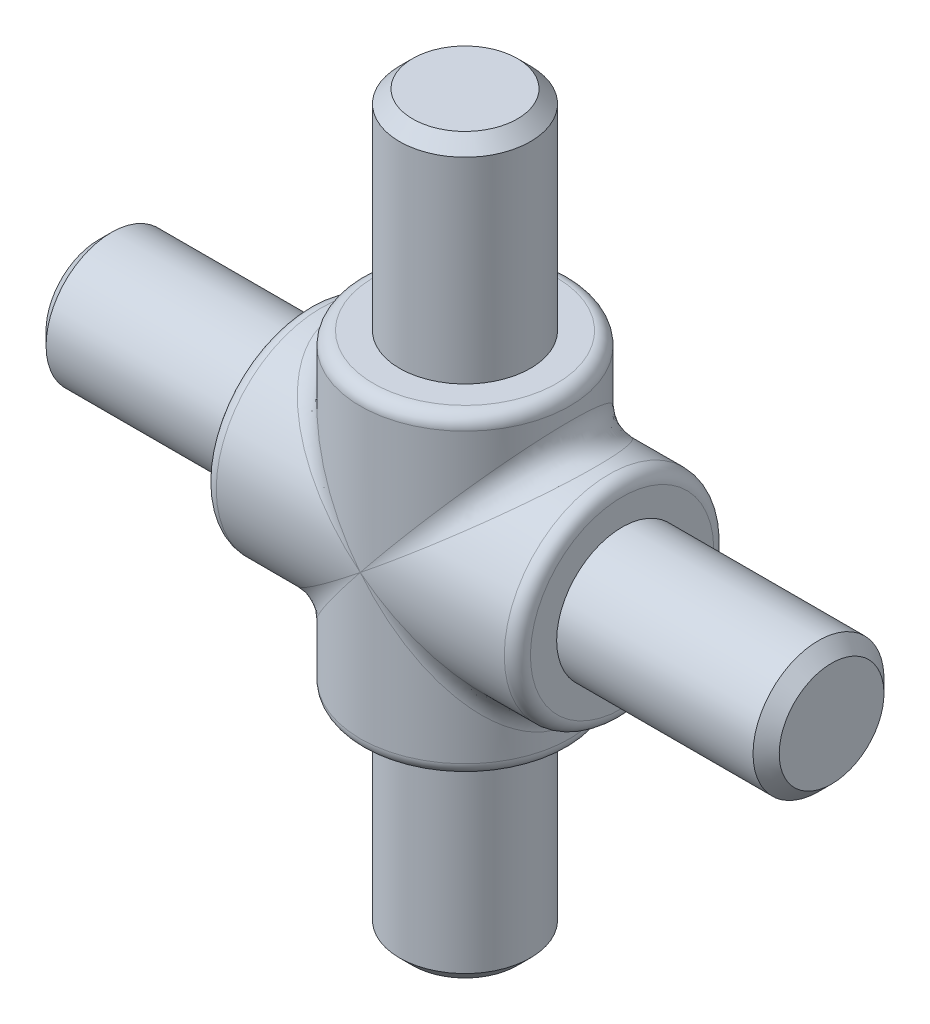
ISO-10303-21;
HEADER;
FILE_DESCRIPTION(('STEP AP214'),'2;1');
FILE_NAME('part.step','',(''),(''),'','','');
FILE_SCHEMA(('AUTOMOTIVE_DESIGN { 1 0 10303 214 1 1 1 1 }'));
ENDSEC;
DATA;
#1=APPLICATION_CONTEXT('core data for automotive mechanical design processes');
#2=APPLICATION_PROTOCOL_DEFINITION('international standard','automotive_design',2000,#1);
#3=PRODUCT_CONTEXT('',#1,'mechanical');
#4=PRODUCT('Part','Part','',(#3));
#5=PRODUCT_RELATED_PRODUCT_CATEGORY('part','',(#4));
#6=PRODUCT_DEFINITION_FORMATION('','',#4);
#7=PRODUCT_DEFINITION_CONTEXT('part definition',#1,'design');
#8=PRODUCT_DEFINITION('design','',#6,#7);
#9=PRODUCT_DEFINITION_SHAPE('','',#8);
#10=(LENGTH_UNIT() NAMED_UNIT(*) SI_UNIT(.MILLI.,.METRE.));
#11=(NAMED_UNIT(*) PLANE_ANGLE_UNIT() SI_UNIT($,.RADIAN.));
#12=(NAMED_UNIT(*) SI_UNIT($,.STERADIAN.) SOLID_ANGLE_UNIT());
#13=UNCERTAINTY_MEASURE_WITH_UNIT(LENGTH_MEASURE(1.E-05),#10,'distance_accuracy_value','');
#14=(GEOMETRIC_REPRESENTATION_CONTEXT(3) GLOBAL_UNCERTAINTY_ASSIGNED_CONTEXT((#13)) GLOBAL_UNIT_ASSIGNED_CONTEXT((#10,
#11,#12)) REPRESENTATION_CONTEXT('',''));
#15=CARTESIAN_POINT('',(0.,0.,0.));
#16=DIRECTION('',(0.,0.,1.));
#17=DIRECTION('',(1.,0.,0.));
#18=AXIS2_PLACEMENT_3D('',#15,#16,#17);
#19=CARTESIAN_POINT('',(0.,28.,0.));
#20=DIRECTION('',(0.,1.,0.));
#21=DIRECTION('',(0.,0.,1.));
#22=AXIS2_PLACEMENT_3D('',#19,#20,#21);
#23=CYLINDRICAL_SURFACE('',#22,8.);
#24=CARTESIAN_POINT('',(0.,-11.,0.));
#25=DIRECTION('',(0.,1.,0.));
#26=DIRECTION('',(0.,0.,1.));
#27=AXIS2_PLACEMENT_3D('',#24,#25,#26);
#28=CIRCLE('',#27,8.);
#29=CARTESIAN_POINT('',(0.,-11.,8.));
#30=VERTEX_POINT('',#29);
#31=EDGE_CURVE('E179',#30,#30,#28,.T.);
#32=ORIENTED_EDGE('',*,*,#31,.T.);
#33=EDGE_LOOP('',(#32));
#34=FACE_BOUND('',#33,.T.);
#35=CARTESIAN_POINT('',(0.,0.,0.));
#36=DIRECTION('',(-0.780868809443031,-0.624695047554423,0.));
#37=DIRECTION('',(-0.624695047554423,0.780868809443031,0.));
#38=AXIS2_PLACEMENT_3D('',#35,#36,#37);
#39=ELLIPSE('',#38,12.8062484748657,8.);
#40=CARTESIAN_POINT('',(0.,0.,-8.));
#41=VERTEX_POINT('',#40);
#42=CARTESIAN_POINT('',(0.,0.,8.));
#43=VERTEX_POINT('',#42);
#44=EDGE_CURVE('E77',#41,#43,#39,.T.);
#45=ORIENTED_EDGE('',*,*,#44,.T.);
#46=CARTESIAN_POINT('',(0.,0.,0.));
#47=DIRECTION('',(0.780868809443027,-0.624695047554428,0.));
#48=DIRECTION('',(-0.624695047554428,-0.780868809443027,0.));
#49=AXIS2_PLACEMENT_3D('',#46,#47,#48);
#50=ELLIPSE('',#49,12.8062484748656,8.);
#51=EDGE_CURVE('E76',#43,#41,#50,.T.);
#52=ORIENTED_EDGE('',*,*,#51,.T.);
#53=EDGE_LOOP('',(#45,#52));
#54=FACE_BOUND('',#53,.T.);
#55=ADVANCED_FACE('F34',(#34,#54),#23,.T.);
#56=CARTESIAN_POINT('',(0.,11.,0.));
#57=DIRECTION('',(0.,-1.,0.));
#58=DIRECTION('',(0.,0.,-1.));
#59=AXIS2_PLACEMENT_3D('',#56,#57,#58);
#60=CIRCLE('',#59,8.);
#61=CARTESIAN_POINT('',(0.,11.,-8.));
#62=VERTEX_POINT('',#61);
#63=EDGE_CURVE('E157',#62,#62,#60,.T.);
#64=ORIENTED_EDGE('',*,*,#63,.T.);
#65=EDGE_LOOP('',(#64));
#66=FACE_BOUND('',#65,.T.);
#67=CARTESIAN_POINT('',(0.,0.,0.));
#68=DIRECTION('',(0.780868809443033,0.62469504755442,0.));
#69=DIRECTION('',(-0.62469504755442,0.780868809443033,0.));
#70=AXIS2_PLACEMENT_3D('',#67,#68,#69);
#71=ELLIPSE('',#70,12.8062484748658,8.);
#72=EDGE_CURVE('E47',#41,#43,#71,.T.);
#73=ORIENTED_EDGE('',*,*,#72,.T.);
#74=CARTESIAN_POINT('',(0.,0.,0.));
#75=DIRECTION('',(-0.780868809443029,0.624695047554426,0.));
#76=DIRECTION('',(0.624695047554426,0.780868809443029,0.));
#77=AXIS2_PLACEMENT_3D('',#74,#75,#76);
#78=ELLIPSE('',#77,12.8062484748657,8.);
#79=EDGE_CURVE('E11',#43,#41,#78,.T.);
#80=ORIENTED_EDGE('',*,*,#79,.T.);
#81=EDGE_LOOP('',(#73,#80));
#82=FACE_BOUND('',#81,.T.);
#83=ADVANCED_FACE('F65',(#66,#82),#23,.T.);
#84=CARTESIAN_POINT('',(28.,0.,0.));
#85=DIRECTION('',(1.,0.,0.));
#86=DIRECTION('',(0.,0.,1.));
#87=AXIS2_PLACEMENT_3D('',#84,#85,#86);
#88=CYLINDRICAL_SURFACE('',#87,8.);
#89=CARTESIAN_POINT('',(11.,0.,0.));
#90=DIRECTION('',(-1.,0.,0.));
#91=DIRECTION('',(0.,-1.,0.));
#92=AXIS2_PLACEMENT_3D('',#89,#90,#91);
#93=CIRCLE('',#92,8.);
#94=CARTESIAN_POINT('',(11.,-8.00000000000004,0.));
#95=VERTEX_POINT('',#94);
#96=EDGE_CURVE('E173',#95,#95,#93,.T.);
#97=ORIENTED_EDGE('',*,*,#96,.T.);
#98=EDGE_LOOP('',(#97));
#99=FACE_BOUND('',#98,.T.);
#100=CARTESIAN_POINT('',(0.,0.,0.));
#101=DIRECTION('',(-0.624695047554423,0.780868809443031,0.));
#102=DIRECTION('',(0.780868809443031,0.624695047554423,0.));
#103=AXIS2_PLACEMENT_3D('',#100,#101,#102);
#104=ELLIPSE('',#103,12.8062484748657,8.);
#105=EDGE_CURVE('E69',#41,#43,#104,.F.);
#106=ORIENTED_EDGE('',*,*,#105,.T.);
#107=CARTESIAN_POINT('',(0.,0.,0.));
#108=DIRECTION('',(-0.624695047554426,-0.780868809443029,0.));
#109=DIRECTION('',(-0.780868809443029,0.624695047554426,0.));
#110=AXIS2_PLACEMENT_3D('',#107,#108,#109);
#111=ELLIPSE('',#110,12.8062484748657,8.);
#112=EDGE_CURVE('E62',#43,#41,#111,.F.);
#113=ORIENTED_EDGE('',*,*,#112,.T.);
#114=EDGE_LOOP('',(#106,#113));
#115=FACE_BOUND('',#114,.T.);
#116=ADVANCED_FACE('F68',(#99,#115),#88,.T.);
#117=CARTESIAN_POINT('',(8.,12.,0.));
#118=DIRECTION('',(0.,-1.,0.));
#119=DIRECTION('',(0.,0.,-1.));
#120=AXIS2_PLACEMENT_3D('',#117,#118,#119);
#121=PLANE('',#120);
#122=CARTESIAN_POINT('',(0.,12.,0.));
#123=DIRECTION('',(0.,-1.,0.));
#124=DIRECTION('',(0.,0.,-1.));
#125=AXIS2_PLACEMENT_3D('',#122,#123,#124);
#126=CIRCLE('',#125,7.);
#127=CARTESIAN_POINT('',(0.,12.,-7.));
#128=VERTEX_POINT('',#127);
#129=EDGE_CURVE('E153',#128,#128,#126,.F.);
#130=ORIENTED_EDGE('',*,*,#129,.T.);
#131=EDGE_LOOP('',(#130));
#132=FACE_BOUND('',#131,.T.);
#133=CARTESIAN_POINT('',(0.,12.,0.));
#134=DIRECTION('',(0.,1.,0.));
#135=DIRECTION('',(0.,0.,1.));
#136=AXIS2_PLACEMENT_3D('',#133,#134,#135);
#137=CIRCLE('',#136,5.);
#138=CARTESIAN_POINT('',(0.,12.,5.));
#139=VERTEX_POINT('',#138);
#140=EDGE_CURVE('E151',#139,#139,#137,.T.);
#141=ORIENTED_EDGE('',*,*,#140,.F.);
#142=EDGE_LOOP('',(#141));
#143=FACE_BOUND('',#142,.T.);
#144=ADVANCED_FACE('F116',(#132,#143),#121,.F.);
#145=CARTESIAN_POINT('',(0.,28.,0.));
#146=DIRECTION('',(0.,1.,0.));
#147=DIRECTION('',(0.,0.,1.));
#148=AXIS2_PLACEMENT_3D('',#145,#146,#147);
#149=CYLINDRICAL_SURFACE('',#148,5.);
#150=CARTESIAN_POINT('',(0.,27.,0.));
#151=DIRECTION('',(0.,-1.,0.));
#152=DIRECTION('',(0.,0.,-1.));
#153=AXIS2_PLACEMENT_3D('',#150,#151,#152);
#154=CIRCLE('',#153,5.);
#155=CARTESIAN_POINT('',(0.,27.,-5.));
#156=VERTEX_POINT('',#155);
#157=EDGE_CURVE('E148',#156,#156,#154,.T.);
#158=ORIENTED_EDGE('',*,*,#157,.T.);
#159=EDGE_LOOP('',(#158));
#160=FACE_BOUND('',#159,.T.);
#161=ORIENTED_EDGE('',*,*,#140,.T.);
#162=EDGE_LOOP('',(#161));
#163=FACE_BOUND('',#162,.T.);
#164=ADVANCED_FACE('F137',(#160,#163),#149,.T.);
#165=CARTESIAN_POINT('',(5.,28.,0.));
#166=DIRECTION('',(0.,-1.,0.));
#167=DIRECTION('',(0.,0.,-1.));
#168=AXIS2_PLACEMENT_3D('',#165,#166,#167);
#169=PLANE('',#168);
#170=CARTESIAN_POINT('',(0.,28.,0.));
#171=DIRECTION('',(0.,-1.,0.));
#172=DIRECTION('',(0.,0.,-1.));
#173=AXIS2_PLACEMENT_3D('',#170,#171,#172);
#174=CIRCLE('',#173,4.);
#175=CARTESIAN_POINT('',(0.,28.,-4.));
#176=VERTEX_POINT('',#175);
#177=EDGE_CURVE('E166',#176,#176,#174,.F.);
#178=ORIENTED_EDGE('',*,*,#177,.T.);
#179=EDGE_LOOP('',(#178));
#180=FACE_BOUND('',#179,.T.);
#181=ADVANCED_FACE('F134',(#180),#169,.F.);
#182=CARTESIAN_POINT('',(0.,11.,0.));
#183=DIRECTION('',(0.,-1.,0.));
#184=DIRECTION('',(0.,0.,-1.));
#185=AXIS2_PLACEMENT_3D('',#182,#183,#184);
#186=TOROIDAL_SURFACE('',#185,7.,1.);
#187=ORIENTED_EDGE('',*,*,#63,.F.);
#188=EDGE_LOOP('',(#187));
#189=FACE_BOUND('',#188,.T.);
#190=ORIENTED_EDGE('',*,*,#129,.F.);
#191=EDGE_LOOP('',(#190));
#192=FACE_BOUND('',#191,.T.);
#193=ADVANCED_FACE('F118',(#189,#192),#186,.T.);
#194=CARTESIAN_POINT('',(0.,28.,0.));
#195=DIRECTION('',(0.,-1.,0.));
#196=DIRECTION('',(0.,0.,-1.));
#197=AXIS2_PLACEMENT_3D('',#194,#195,#196);
#198=CONICAL_SURFACE('',#197,4.,0.785398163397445);
#199=ORIENTED_EDGE('',*,*,#157,.F.);
#200=EDGE_LOOP('',(#199));
#201=FACE_BOUND('',#200,.T.);
#202=ORIENTED_EDGE('',*,*,#177,.F.);
#203=EDGE_LOOP('',(#202));
#204=FACE_BOUND('',#203,.T.);
#205=ADVANCED_FACE('F264',(#201,#204),#198,.T.);
#206=CARTESIAN_POINT('',(12.,-8.00000000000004,0.));
#207=DIRECTION('',(-1.,0.,0.));
#208=DIRECTION('',(0.,0.,-1.));
#209=AXIS2_PLACEMENT_3D('',#206,#207,#208);
#210=PLANE('',#209);
#211=CARTESIAN_POINT('',(12.,0.,0.));
#212=DIRECTION('',(-1.,0.,0.));
#213=DIRECTION('',(0.,-1.,0.));
#214=AXIS2_PLACEMENT_3D('',#211,#212,#213);
#215=CIRCLE('',#214,7.);
#216=CARTESIAN_POINT('',(12.,-7.00000000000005,0.));
#217=VERTEX_POINT('',#216);
#218=EDGE_CURVE('E170',#217,#217,#215,.F.);
#219=ORIENTED_EDGE('',*,*,#218,.T.);
#220=EDGE_LOOP('',(#219));
#221=FACE_BOUND('',#220,.T.);
#222=CARTESIAN_POINT('',(12.,0.,0.));
#223=DIRECTION('',(1.,0.,0.));
#224=DIRECTION('',(0.,0.,1.));
#225=AXIS2_PLACEMENT_3D('',#222,#223,#224);
#226=CIRCLE('',#225,5.);
#227=CARTESIAN_POINT('',(12.,0.,5.));
#228=VERTEX_POINT('',#227);
#229=EDGE_CURVE('E154',#228,#228,#226,.T.);
#230=ORIENTED_EDGE('',*,*,#229,.F.);
#231=EDGE_LOOP('',(#230));
#232=FACE_BOUND('',#231,.T.);
#233=ADVANCED_FACE('F132',(#221,#232),#210,.F.);
#234=CARTESIAN_POINT('',(28.,0.,0.));
#235=DIRECTION('',(1.,0.,0.));
#236=DIRECTION('',(0.,0.,1.));
#237=AXIS2_PLACEMENT_3D('',#234,#235,#236);
#238=CYLINDRICAL_SURFACE('',#237,5.);
#239=CARTESIAN_POINT('',(27.,0.,0.));
#240=DIRECTION('',(-1.,0.,0.));
#241=DIRECTION('',(0.,-1.,0.));
#242=AXIS2_PLACEMENT_3D('',#239,#240,#241);
#243=CIRCLE('',#242,5.);
#244=CARTESIAN_POINT('',(27.,-5.0000000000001,0.));
#245=VERTEX_POINT('',#244);
#246=EDGE_CURVE('E191',#245,#245,#243,.T.);
#247=ORIENTED_EDGE('',*,*,#246,.T.);
#248=EDGE_LOOP('',(#247));
#249=FACE_BOUND('',#248,.T.);
#250=ORIENTED_EDGE('',*,*,#229,.T.);
#251=EDGE_LOOP('',(#250));
#252=FACE_BOUND('',#251,.T.);
#253=ADVANCED_FACE('F256',(#249,#252),#238,.T.);
#254=CARTESIAN_POINT('',(28.,-5.0000000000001,0.));
#255=DIRECTION('',(-1.,0.,0.));
#256=DIRECTION('',(0.,0.,-1.));
#257=AXIS2_PLACEMENT_3D('',#254,#255,#256);
#258=PLANE('',#257);
#259=CARTESIAN_POINT('',(28.,0.,0.));
#260=DIRECTION('',(-1.,0.,0.));
#261=DIRECTION('',(0.,-1.,0.));
#262=AXIS2_PLACEMENT_3D('',#259,#260,#261);
#263=CIRCLE('',#262,4.);
#264=CARTESIAN_POINT('',(28.,-4.0000000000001,0.));
#265=VERTEX_POINT('',#264);
#266=EDGE_CURVE('E188',#265,#265,#263,.F.);
#267=ORIENTED_EDGE('',*,*,#266,.T.);
#268=EDGE_LOOP('',(#267));
#269=FACE_BOUND('',#268,.T.);
#270=ADVANCED_FACE('F247',(#269),#258,.F.);
#271=CARTESIAN_POINT('',(-8.,-12.,0.));
#272=DIRECTION('',(0.,1.,0.));
#273=DIRECTION('',(0.,0.,-1.));
#274=AXIS2_PLACEMENT_3D('',#271,#272,#273);
#275=PLANE('',#274);
#276=CARTESIAN_POINT('',(0.,-12.,0.));
#277=DIRECTION('',(0.,1.,0.));
#278=DIRECTION('',(0.,0.,1.));
#279=AXIS2_PLACEMENT_3D('',#276,#277,#278);
#280=CIRCLE('',#279,7.);
#281=CARTESIAN_POINT('',(0.,-12.,7.));
#282=VERTEX_POINT('',#281);
#283=EDGE_CURVE('E176',#282,#282,#280,.F.);
#284=ORIENTED_EDGE('',*,*,#283,.T.);
#285=EDGE_LOOP('',(#284));
#286=FACE_BOUND('',#285,.T.);
#287=CARTESIAN_POINT('',(0.,-12.,0.));
#288=DIRECTION('',(0.,-1.,0.));
#289=DIRECTION('',(0.,0.,1.));
#290=AXIS2_PLACEMENT_3D('',#287,#288,#289);
#291=CIRCLE('',#290,5.);
#292=CARTESIAN_POINT('',(0.,-12.,5.));
#293=VERTEX_POINT('',#292);
#294=EDGE_CURVE('E160',#293,#293,#291,.T.);
#295=ORIENTED_EDGE('',*,*,#294,.F.);
#296=EDGE_LOOP('',(#295));
#297=FACE_BOUND('',#296,.T.);
#298=ADVANCED_FACE('F245',(#286,#297),#275,.F.);
#299=CARTESIAN_POINT('',(0.,-28.,0.));
#300=DIRECTION('',(0.,-1.,0.));
#301=DIRECTION('',(0.,0.,1.));
#302=AXIS2_PLACEMENT_3D('',#299,#300,#301);
#303=CYLINDRICAL_SURFACE('',#302,5.);
#304=CARTESIAN_POINT('',(0.,-27.,0.));
#305=DIRECTION('',(0.,1.,0.));
#306=DIRECTION('',(0.,0.,1.));
#307=AXIS2_PLACEMENT_3D('',#304,#305,#306);
#308=CIRCLE('',#307,5.);
#309=CARTESIAN_POINT('',(0.,-27.,5.));
#310=VERTEX_POINT('',#309);
#311=EDGE_CURVE('E197',#310,#310,#308,.T.);
#312=ORIENTED_EDGE('',*,*,#311,.T.);
#313=EDGE_LOOP('',(#312));
#314=FACE_BOUND('',#313,.T.);
#315=ORIENTED_EDGE('',*,*,#294,.T.);
#316=EDGE_LOOP('',(#315));
#317=FACE_BOUND('',#316,.T.);
#318=ADVANCED_FACE('F243',(#314,#317),#303,.T.);
#319=CARTESIAN_POINT('',(-5.,-28.,0.));
#320=DIRECTION('',(0.,1.,0.));
#321=DIRECTION('',(0.,0.,-1.));
#322=AXIS2_PLACEMENT_3D('',#319,#320,#321);
#323=PLANE('',#322);
#324=CARTESIAN_POINT('',(0.,-28.,0.));
#325=DIRECTION('',(0.,1.,0.));
#326=DIRECTION('',(0.,0.,1.));
#327=AXIS2_PLACEMENT_3D('',#324,#325,#326);
#328=CIRCLE('',#327,4.);
#329=CARTESIAN_POINT('',(0.,-28.,4.));
#330=VERTEX_POINT('',#329);
#331=EDGE_CURVE('E194',#330,#330,#328,.F.);
#332=ORIENTED_EDGE('',*,*,#331,.T.);
#333=EDGE_LOOP('',(#332));
#334=FACE_BOUND('',#333,.T.);
#335=ADVANCED_FACE('F232',(#334),#323,.F.);
#336=CARTESIAN_POINT('',(-28.,2.93284432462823E-13,0.));
#337=DIRECTION('',(-1.,0.,0.));
#338=DIRECTION('',(0.,0.,1.));
#339=AXIS2_PLACEMENT_3D('',#336,#337,#338);
#340=CYLINDRICAL_SURFACE('',#339,8.);
#341=CARTESIAN_POINT('',(-11.,1.15218884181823E-13,0.));
#342=DIRECTION('',(1.,0.,0.));
#343=DIRECTION('',(0.,1.,0.));
#344=AXIS2_PLACEMENT_3D('',#341,#342,#343);
#345=CIRCLE('',#344,8.);
#346=CARTESIAN_POINT('',(-10.9999999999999,8.00000000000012,0.));
#347=VERTEX_POINT('',#346);
#348=EDGE_CURVE('E185',#347,#347,#345,.T.);
#349=ORIENTED_EDGE('',*,*,#348,.T.);
#350=EDGE_LOOP('',(#349));
#351=FACE_BOUND('',#350,.T.);
#352=CARTESIAN_POINT('',(0.,0.,0.));
#353=DIRECTION('',(0.624695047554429,0.780868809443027,0.));
#354=DIRECTION('',(-0.780868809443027,0.624695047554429,0.));
#355=AXIS2_PLACEMENT_3D('',#352,#353,#354);
#356=ELLIPSE('',#355,12.8062484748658,8.);
#357=EDGE_CURVE('E59',#43,#41,#356,.F.);
#358=ORIENTED_EDGE('',*,*,#357,.T.);
#359=CARTESIAN_POINT('',(0.,0.,0.));
#360=DIRECTION('',(0.62469504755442,-0.780868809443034,0.));
#361=DIRECTION('',(-0.780868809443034,-0.62469504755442,0.));
#362=AXIS2_PLACEMENT_3D('',#359,#360,#361);
#363=ELLIPSE('',#362,12.8062484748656,8.);
#364=EDGE_CURVE('E84',#41,#43,#363,.F.);
#365=ORIENTED_EDGE('',*,*,#364,.T.);
#366=EDGE_LOOP('',(#358,#365));
#367=FACE_BOUND('',#366,.T.);
#368=ADVANCED_FACE('F83',(#351,#367),#340,.T.);
#369=CARTESIAN_POINT('',(-11.9999999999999,8.00000000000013,0.));
#370=DIRECTION('',(1.,0.,0.));
#371=DIRECTION('',(0.,0.,-1.));
#372=AXIS2_PLACEMENT_3D('',#369,#370,#371);
#373=PLANE('',#372);
#374=CARTESIAN_POINT('',(-12.,1.25693328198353E-13,0.));
#375=DIRECTION('',(1.,0.,0.));
#376=DIRECTION('',(0.,1.,0.));
#377=AXIS2_PLACEMENT_3D('',#374,#375,#376);
#378=CIRCLE('',#377,7.);
#379=CARTESIAN_POINT('',(-11.9999999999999,7.00000000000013,0.));
#380=VERTEX_POINT('',#379);
#381=EDGE_CURVE('E182',#380,#380,#378,.F.);
#382=ORIENTED_EDGE('',*,*,#381,.T.);
#383=EDGE_LOOP('',(#382));
#384=FACE_BOUND('',#383,.T.);
#385=CARTESIAN_POINT('',(-12.,1.25693328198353E-13,0.));
#386=DIRECTION('',(-1.,0.,0.));
#387=DIRECTION('',(0.,0.,1.));
#388=AXIS2_PLACEMENT_3D('',#385,#386,#387);
#389=CIRCLE('',#388,5.);
#390=CARTESIAN_POINT('',(-12.,1.25693328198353E-13,5.));
#391=VERTEX_POINT('',#390);
#392=EDGE_CURVE('E238',#391,#391,#389,.T.);
#393=ORIENTED_EDGE('',*,*,#392,.F.);
#394=EDGE_LOOP('',(#393));
#395=FACE_BOUND('',#394,.T.);
#396=ADVANCED_FACE('F225',(#384,#395),#373,.F.);
#397=CARTESIAN_POINT('',(-28.,2.93284432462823E-13,0.));
#398=DIRECTION('',(-1.,0.,0.));
#399=DIRECTION('',(0.,0.,1.));
#400=AXIS2_PLACEMENT_3D('',#397,#398,#399);
#401=CYLINDRICAL_SURFACE('',#400,5.);
#402=CARTESIAN_POINT('',(-27.,2.82809988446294E-13,0.));
#403=DIRECTION('',(1.,0.,0.));
#404=DIRECTION('',(0.,1.,0.));
#405=AXIS2_PLACEMENT_3D('',#402,#403,#404);
#406=CIRCLE('',#405,5.);
#407=CARTESIAN_POINT('',(-26.9999999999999,5.00000000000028,0.));
#408=VERTEX_POINT('',#407);
#409=EDGE_CURVE('E85',#408,#408,#406,.T.);
#410=ORIENTED_EDGE('',*,*,#409,.T.);
#411=EDGE_LOOP('',(#410));
#412=FACE_BOUND('',#411,.T.);
#413=ORIENTED_EDGE('',*,*,#392,.T.);
#414=EDGE_LOOP('',(#413));
#415=FACE_BOUND('',#414,.T.);
#416=ADVANCED_FACE('F206',(#412,#415),#401,.T.);
#417=CARTESIAN_POINT('',(-28.,5.00000000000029,0.));
#418=DIRECTION('',(1.,0.,0.));
#419=DIRECTION('',(0.,0.,-1.));
#420=AXIS2_PLACEMENT_3D('',#417,#418,#419);
#421=PLANE('',#420);
#422=CARTESIAN_POINT('',(-28.,2.93284432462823E-13,0.));
#423=DIRECTION('',(1.,0.,0.));
#424=DIRECTION('',(0.,1.,0.));
#425=AXIS2_PLACEMENT_3D('',#422,#423,#424);
#426=CIRCLE('',#425,4.);
#427=CARTESIAN_POINT('',(-28.,4.0000000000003,0.));
#428=VERTEX_POINT('',#427);
#429=EDGE_CURVE('E200',#428,#428,#426,.F.);
#430=ORIENTED_EDGE('',*,*,#429,.T.);
#431=EDGE_LOOP('',(#430));
#432=FACE_BOUND('',#431,.T.);
#433=ADVANCED_FACE('F214',(#432),#421,.F.);
#434=CARTESIAN_POINT('',(11.,0.,0.));
#435=DIRECTION('',(-1.,0.,0.));
#436=DIRECTION('',(0.,-1.,0.));
#437=AXIS2_PLACEMENT_3D('',#434,#435,#436);
#438=TOROIDAL_SURFACE('',#437,7.,1.);
#439=ORIENTED_EDGE('',*,*,#96,.F.);
#440=EDGE_LOOP('',(#439));
#441=FACE_BOUND('',#440,.T.);
#442=ORIENTED_EDGE('',*,*,#218,.F.);
#443=EDGE_LOOP('',(#442));
#444=FACE_BOUND('',#443,.T.);
#445=ADVANCED_FACE('F216',(#441,#444),#438,.T.);
#446=CARTESIAN_POINT('',(0.,-11.,0.));
#447=DIRECTION('',(0.,1.,0.));
#448=DIRECTION('',(0.,0.,1.));
#449=AXIS2_PLACEMENT_3D('',#446,#447,#448);
#450=TOROIDAL_SURFACE('',#449,7.,1.);
#451=ORIENTED_EDGE('',*,*,#31,.F.);
#452=EDGE_LOOP('',(#451));
#453=FACE_BOUND('',#452,.T.);
#454=ORIENTED_EDGE('',*,*,#283,.F.);
#455=EDGE_LOOP('',(#454));
#456=FACE_BOUND('',#455,.T.);
#457=ADVANCED_FACE('F222',(#453,#456),#450,.T.);
#458=CARTESIAN_POINT('',(-11.,1.15218884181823E-13,0.));
#459=DIRECTION('',(1.,0.,0.));
#460=DIRECTION('',(0.,1.,0.));
#461=AXIS2_PLACEMENT_3D('',#458,#459,#460);
#462=TOROIDAL_SURFACE('',#461,7.,1.);
#463=ORIENTED_EDGE('',*,*,#348,.F.);
#464=EDGE_LOOP('',(#463));
#465=FACE_BOUND('',#464,.T.);
#466=ORIENTED_EDGE('',*,*,#381,.F.);
#467=EDGE_LOOP('',(#466));
#468=FACE_BOUND('',#467,.T.);
#469=ADVANCED_FACE('F274',(#465,#468),#462,.T.);
#470=CARTESIAN_POINT('',(28.,0.,0.));
#471=DIRECTION('',(-1.,0.,0.));
#472=DIRECTION('',(0.,-1.,0.));
#473=AXIS2_PLACEMENT_3D('',#470,#471,#472);
#474=CONICAL_SURFACE('',#473,4.,0.785398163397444);
#475=ORIENTED_EDGE('',*,*,#246,.F.);
#476=EDGE_LOOP('',(#475));
#477=FACE_BOUND('',#476,.T.);
#478=ORIENTED_EDGE('',*,*,#266,.F.);
#479=EDGE_LOOP('',(#478));
#480=FACE_BOUND('',#479,.T.);
#481=ADVANCED_FACE('F271',(#477,#480),#474,.T.);
#482=CARTESIAN_POINT('',(0.,-28.,0.));
#483=DIRECTION('',(0.,1.,0.));
#484=DIRECTION('',(0.,0.,1.));
#485=AXIS2_PLACEMENT_3D('',#482,#483,#484);
#486=CONICAL_SURFACE('',#485,4.,0.785398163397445);
#487=ORIENTED_EDGE('',*,*,#311,.F.);
#488=EDGE_LOOP('',(#487));
#489=FACE_BOUND('',#488,.T.);
#490=ORIENTED_EDGE('',*,*,#331,.F.);
#491=EDGE_LOOP('',(#490));
#492=FACE_BOUND('',#491,.T.);
#493=ADVANCED_FACE('F211',(#489,#492),#486,.T.);
#494=CARTESIAN_POINT('',(-28.,2.93284432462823E-13,0.));
#495=DIRECTION('',(1.,0.,0.));
#496=DIRECTION('',(0.,1.,0.));
#497=AXIS2_PLACEMENT_3D('',#494,#495,#496);
#498=CONICAL_SURFACE('',#497,4.,0.785398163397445);
#499=ORIENTED_EDGE('',*,*,#409,.F.);
#500=EDGE_LOOP('',(#499));
#501=FACE_BOUND('',#500,.T.);
#502=ORIENTED_EDGE('',*,*,#429,.F.);
#503=EDGE_LOOP('',(#502));
#504=FACE_BOUND('',#503,.T.);
#505=ADVANCED_FACE('F103',(#501,#504),#498,.T.);
#506=CARTESIAN_POINT('',(0.,0.,-8.));
#507=CARTESIAN_POINT('',(0.,0.,-8.));
#508=CARTESIAN_POINT('',(0.,0.,-8.));
#509=CARTESIAN_POINT('',(-0.217867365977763,-0.174293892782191,-7.9999899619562));
#510=CARTESIAN_POINT('',(-0.196080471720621,-0.196080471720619,-8.00001630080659));
#511=CARTESIAN_POINT('',(-0.174293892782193,-0.21786736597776,-7.9999899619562));
#512=CARTESIAN_POINT('',(-0.435703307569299,-0.348562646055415,-7.9943042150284));
#513=CARTESIAN_POINT('',(-0.392271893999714,-0.39227189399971,-7.99287385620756));
#514=CARTESIAN_POINT('',(-0.34856264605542,-0.435703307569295,-7.9943042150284));
#515=CARTESIAN_POINT('',(-0.870925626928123,-0.696740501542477,-7.97151368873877));
#516=CARTESIAN_POINT('',(-0.78369351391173,-0.783693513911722,-7.96438737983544));
#517=CARTESIAN_POINT('',(-0.696740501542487,-0.870925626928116,-7.97151368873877));
#518=CARTESIAN_POINT('',(-1.08831196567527,-0.870649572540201,-7.95440795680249));
#519=CARTESIAN_POINT('',(-0.979201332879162,-0.979201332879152,-7.943001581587));
#520=CARTESIAN_POINT('',(-0.870649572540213,-1.08831196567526,-7.95440795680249));
#521=CARTESIAN_POINT('',(-1.73534008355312,-1.38827206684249,-7.88626326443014));
#522=CARTESIAN_POINT('',(-1.56066170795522,-1.56066170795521,-7.85782466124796));
#523=CARTESIAN_POINT('',(-1.38827206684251,-1.7353400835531,-7.88626326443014));
#524=CARTESIAN_POINT('',(-2.16370332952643,-1.73096266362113,-7.81839721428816));
#525=CARTESIAN_POINT('',(-1.9450153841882,-1.94501538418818,-7.77274086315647));
#526=CARTESIAN_POINT('',(-1.73096266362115,-2.16370332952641,-7.81839721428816));
#527=CARTESIAN_POINT('',(-3.0055576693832,-2.40444613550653,-7.63794218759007));
#528=CARTESIAN_POINT('',(-2.69367637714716,-2.69367637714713,-7.54881013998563));
#529=CARTESIAN_POINT('',(-2.40444613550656,-3.00555766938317,-7.63794218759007));
#530=CARTESIAN_POINT('',(-3.41917770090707,-2.73534216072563,-7.52612243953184));
#531=CARTESIAN_POINT('',(-3.06017948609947,-3.06017948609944,-7.40964227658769));
#532=CARTESIAN_POINT('',(-2.73534216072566,-3.41917770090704,-7.52612243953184));
#533=CARTESIAN_POINT('',(-4.2244485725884,-3.37955885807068,-7.25927784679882));
#534=CARTESIAN_POINT('',(-3.76472158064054,-3.7647215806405,-7.08181604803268));
#535=CARTESIAN_POINT('',(-3.37955885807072,-4.22444857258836,-7.25927784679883));
#536=CARTESIAN_POINT('',(-4.61638960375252,-3.69311168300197,-7.10538519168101));
#537=CARTESIAN_POINT('',(-4.10488445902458,-4.10488445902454,-6.89268764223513));
#538=CARTESIAN_POINT('',(-3.69311168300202,-4.61638960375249,-7.10538519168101));
#539=CARTESIAN_POINT('',(-5.37140005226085,-4.29712004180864,-6.75666098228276));
#540=CARTESIAN_POINT('',(-4.74878839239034,-4.74878839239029,-6.47111899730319));
#541=CARTESIAN_POINT('',(-4.2971200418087,-5.3714000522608,-6.75666098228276));
#542=CARTESIAN_POINT('',(-5.73499135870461,-4.58799308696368,-6.56328843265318));
#543=CARTESIAN_POINT('',(-5.05452200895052,-5.05452200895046,-6.23809121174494));
#544=CARTESIAN_POINT('',(-4.58799308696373,-5.73499135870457,-6.56328843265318));
#545=CARTESIAN_POINT('',(-6.42683983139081,-5.14147186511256,-6.13858915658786));
#546=CARTESIAN_POINT('',(-5.62261083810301,-5.62261083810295,-5.73703508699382));
#547=CARTESIAN_POINT('',(-5.14147186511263,-6.42683983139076,-6.13858915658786));
#548=CARTESIAN_POINT('',(-6.75591461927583,-5.40473169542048,-5.90898357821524));
#549=CARTESIAN_POINT('',(-5.88674280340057,-5.88674280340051,-5.46837294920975));
#550=CARTESIAN_POINT('',(-5.40473169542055,-6.75591461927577,-5.90898357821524));
#551=CARTESIAN_POINT('',(-7.37279481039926,-5.89823584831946,-5.41546616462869));
#552=CARTESIAN_POINT('',(-6.36630707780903,-6.36630707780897,-4.90658868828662));
#553=CARTESIAN_POINT('',(-5.89823584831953,-7.3727948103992,-5.41546616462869));
#554=CARTESIAN_POINT('',(-7.66176112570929,-6.12940890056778,-5.15343256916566));
#555=CARTESIAN_POINT('',(-6.58320014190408,-6.58320014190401,-4.61291825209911));
#556=CARTESIAN_POINT('',(-6.12940890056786,-7.66176112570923,-5.15343256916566));
#557=CARTESIAN_POINT('',(-8.19309004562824,-6.55447203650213,-4.59948592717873));
#558=CARTESIAN_POINT('',(-6.96559037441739,-6.96559037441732,-4.01359782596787));
#559=CARTESIAN_POINT('',(-6.55447203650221,-8.19309004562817,-4.59948592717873));
#560=CARTESIAN_POINT('',(-8.43696358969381,-6.74957087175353,-4.30944529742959));
#561=CARTESIAN_POINT('',(-7.1321369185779,-7.13213691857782,-3.70769281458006));
#562=CARTESIAN_POINT('',(-6.74957087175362,-8.43696358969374,-4.30944529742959));
#563=CARTESIAN_POINT('',(-8.87368305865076,-7.09894644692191,-3.70422108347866));
#564=CARTESIAN_POINT('',(-7.4149799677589,-7.41497996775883,-3.09686372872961));
#565=CARTESIAN_POINT('',(-7.098946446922,-8.87368305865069,-3.70422108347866));
#566=CARTESIAN_POINT('',(-9.06830690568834,-7.25464552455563,-3.39071363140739));
#567=CARTESIAN_POINT('',(-7.53187054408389,-7.53187054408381,-2.7922371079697));
#568=CARTESIAN_POINT('',(-7.25464552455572,-9.06830690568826,-3.39071363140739));
#569=CARTESIAN_POINT('',(-9.32077516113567,-7.45662012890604,-2.90314851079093));
#570=CARTESIAN_POINT('',(-7.67378168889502,-7.67378168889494,-2.34413099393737));
#571=CARTESIAN_POINT('',(-7.45662012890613,-9.3207751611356,-2.90314851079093));
#572=CARTESIAN_POINT('',(-9.39717441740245,-7.51773953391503,-2.74119046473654));
#573=CARTESIAN_POINT('',(-7.71519559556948,-7.7151955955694,-2.19782358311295));
#574=CARTESIAN_POINT('',(-7.51773953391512,-9.39717441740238,-2.74119046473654));
#575=CARTESIAN_POINT('',(-9.53769607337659,-7.63015685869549,-2.41062813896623));
#576=CARTESIAN_POINT('',(-7.78888405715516,-7.78888405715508,-1.90625765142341));
#577=CARTESIAN_POINT('',(-7.6301568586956,-9.53769607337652,-2.41062813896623));
#578=CARTESIAN_POINT('',(-9.60182440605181,-7.68145952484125,-2.24202711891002));
#579=CARTESIAN_POINT('',(-7.82099196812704,-7.82099196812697,-1.7612476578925));
#580=CARTESIAN_POINT('',(-7.68145952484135,-9.60182440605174,-2.24202711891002));
#581=CARTESIAN_POINT('',(-9.71500095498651,-7.77200076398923,-1.90412675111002));
#582=CARTESIAN_POINT('',(-7.87585239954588,-7.8758523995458,-1.4773618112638));
#583=CARTESIAN_POINT('',(-7.77200076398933,-9.71500095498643,-1.90412675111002));
#584=CARTESIAN_POINT('',(-9.76443761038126,-7.81155008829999,-1.73499414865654));
#585=CARTESIAN_POINT('',(-7.89872331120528,-7.8987233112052,-1.33868728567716));
#586=CARTESIAN_POINT('',(-7.8115500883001,-9.76443761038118,-1.73499414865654));
#587=CARTESIAN_POINT('',(-9.84976806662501,-7.87981445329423,-1.39247748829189));
#588=CARTESIAN_POINT('',(-7.93716164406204,-7.93716164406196,-1.06335424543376));
#589=CARTESIAN_POINT('',(-7.87981445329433,-9.84976806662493,-1.39247748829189));
#590=CARTESIAN_POINT('',(-9.88566841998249,-7.90853473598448,-1.21909553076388));
#591=CARTESIAN_POINT('',(-7.95262794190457,-7.95262794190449,-0.92703635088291));
#592=CARTESIAN_POINT('',(-7.90853473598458,-9.88566841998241,-1.21909553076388));
#593=CARTESIAN_POINT('',(-9.94276566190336,-7.95421252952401,-0.872137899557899));
#594=CARTESIAN_POINT('',(-7.97679455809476,-7.97679455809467,-0.658202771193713));
#595=CARTESIAN_POINT('',(-7.95421252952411,-9.94276566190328,-0.8721378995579));
#596=CARTESIAN_POINT('',(-9.964189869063,-7.97135189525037,-0.698610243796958));
#597=CARTESIAN_POINT('',(-7.985533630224,-7.98553363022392,-0.526009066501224));
#598=CARTESIAN_POINT('',(-7.97135189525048,-9.96418986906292,-0.698610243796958));
#599=CARTESIAN_POINT('',(-9.99280691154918,-7.99424552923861,-0.350055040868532));
#600=CARTESIAN_POINT('',(-7.99715282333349,-7.99715282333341,-0.262357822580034));
#601=CARTESIAN_POINT('',(-7.99424552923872,-9.9928069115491,-0.350055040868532));
#602=CARTESIAN_POINT('',(-9.99999999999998,-7.9999999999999,-0.175027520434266));
#603=CARTESIAN_POINT('',(-8.,-7.99999999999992,-0.131273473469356));
#604=CARTESIAN_POINT('',(-8.,-9.9999999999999,-0.175027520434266));
#605=CARTESIAN_POINT('',(-9.99999999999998,-7.9999999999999,0.175027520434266));
#606=CARTESIAN_POINT('',(-8.,-7.99999999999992,0.131273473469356));
#607=CARTESIAN_POINT('',(-8.,-9.9999999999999,0.175027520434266));
#608=CARTESIAN_POINT('',(-9.99280691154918,-7.99424552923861,0.350055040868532));
#609=CARTESIAN_POINT('',(-7.99715282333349,-7.99715282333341,0.262357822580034));
#610=CARTESIAN_POINT('',(-7.99424552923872,-9.9928069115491,0.350055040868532));
#611=CARTESIAN_POINT('',(-9.964189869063,-7.97135189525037,0.698610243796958));
#612=CARTESIAN_POINT('',(-7.985533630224,-7.98553363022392,0.526009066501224));
#613=CARTESIAN_POINT('',(-7.97135189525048,-9.96418986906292,0.698610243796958));
#614=CARTESIAN_POINT('',(-9.94276566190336,-7.95421252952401,0.872137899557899));
#615=CARTESIAN_POINT('',(-7.97679455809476,-7.97679455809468,0.658202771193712));
#616=CARTESIAN_POINT('',(-7.95421252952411,-9.94276566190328,0.872137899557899));
#617=CARTESIAN_POINT('',(-9.88566841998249,-7.90853473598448,1.21909553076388));
#618=CARTESIAN_POINT('',(-7.95262794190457,-7.95262794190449,0.927036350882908));
#619=CARTESIAN_POINT('',(-7.90853473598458,-9.88566841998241,1.21909553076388));
#620=CARTESIAN_POINT('',(-9.84976806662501,-7.87981445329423,1.39247748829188));
#621=CARTESIAN_POINT('',(-7.93716164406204,-7.93716164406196,1.06335424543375));
#622=CARTESIAN_POINT('',(-7.87981445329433,-9.84976806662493,1.39247748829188));
#623=CARTESIAN_POINT('',(-9.76443761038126,-7.8115500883,1.73499414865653));
#624=CARTESIAN_POINT('',(-7.89872331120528,-7.8987233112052,1.33868728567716));
#625=CARTESIAN_POINT('',(-7.8115500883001,-9.76443761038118,1.73499414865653));
#626=CARTESIAN_POINT('',(-9.71500095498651,-7.77200076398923,1.90412675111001));
#627=CARTESIAN_POINT('',(-7.87585239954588,-7.8758523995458,1.4773618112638));
#628=CARTESIAN_POINT('',(-7.77200076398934,-9.71500095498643,1.90412675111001));
#629=CARTESIAN_POINT('',(-9.60182440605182,-7.68145952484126,2.24202711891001));
#630=CARTESIAN_POINT('',(-7.82099196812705,-7.82099196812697,1.76124765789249));
#631=CARTESIAN_POINT('',(-7.68145952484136,-9.60182440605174,2.24202711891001));
#632=CARTESIAN_POINT('',(-9.5376960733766,-7.6301568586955,2.41062813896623));
#633=CARTESIAN_POINT('',(-7.78888405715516,-7.78888405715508,1.90625765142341));
#634=CARTESIAN_POINT('',(-7.6301568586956,-9.53769607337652,2.41062813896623));
#635=CARTESIAN_POINT('',(-9.39717441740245,-7.51773953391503,2.74119046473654));
#636=CARTESIAN_POINT('',(-7.71519559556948,-7.7151955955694,2.19782358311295));
#637=CARTESIAN_POINT('',(-7.51773953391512,-9.39717441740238,2.74119046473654));
#638=CARTESIAN_POINT('',(-9.32077516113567,-7.45662012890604,2.90314851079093));
#639=CARTESIAN_POINT('',(-7.67378168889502,-7.67378168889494,2.34413099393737));
#640=CARTESIAN_POINT('',(-7.45662012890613,-9.3207751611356,2.90314851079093));
#641=CARTESIAN_POINT('',(-9.06830690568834,-7.25464552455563,3.39071363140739));
#642=CARTESIAN_POINT('',(-7.53187054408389,-7.53187054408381,2.7922371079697));
#643=CARTESIAN_POINT('',(-7.25464552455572,-9.06830690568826,3.39071363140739));
#644=CARTESIAN_POINT('',(-8.87368305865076,-7.09894644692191,3.70422108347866));
#645=CARTESIAN_POINT('',(-7.41497996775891,-7.41497996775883,3.09686372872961));
#646=CARTESIAN_POINT('',(-7.09894644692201,-8.87368305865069,3.70422108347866));
#647=CARTESIAN_POINT('',(-8.43696358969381,-6.74957087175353,4.30944529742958));
#648=CARTESIAN_POINT('',(-7.1321369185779,-7.13213691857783,3.70769281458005));
#649=CARTESIAN_POINT('',(-6.74957087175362,-8.43696358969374,4.30944529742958));
#650=CARTESIAN_POINT('',(-8.19309004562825,-6.55447203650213,4.59948592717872));
#651=CARTESIAN_POINT('',(-6.96559037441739,-6.96559037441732,4.01359782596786));
#652=CARTESIAN_POINT('',(-6.55447203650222,-8.19309004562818,4.59948592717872));
#653=CARTESIAN_POINT('',(-7.6617611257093,-6.12940890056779,5.15343256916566));
#654=CARTESIAN_POINT('',(-6.58320014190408,-6.58320014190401,4.61291825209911));
#655=CARTESIAN_POINT('',(-6.12940890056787,-7.66176112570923,5.15343256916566));
#656=CARTESIAN_POINT('',(-7.37279481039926,-5.89823584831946,5.41546616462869));
#657=CARTESIAN_POINT('',(-6.36630707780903,-6.36630707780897,4.90658868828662));
#658=CARTESIAN_POINT('',(-5.89823584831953,-7.3727948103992,5.41546616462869));
#659=CARTESIAN_POINT('',(-6.75591461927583,-5.40473169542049,5.90898357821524));
#660=CARTESIAN_POINT('',(-5.88674280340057,-5.88674280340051,5.46837294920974));
#661=CARTESIAN_POINT('',(-5.40473169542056,-6.75591461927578,5.90898357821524));
#662=CARTESIAN_POINT('',(-6.42683983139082,-5.14147186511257,6.13858915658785));
#663=CARTESIAN_POINT('',(-5.62261083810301,-5.62261083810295,5.73703508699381));
#664=CARTESIAN_POINT('',(-5.14147186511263,-6.42683983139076,6.13858915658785));
#665=CARTESIAN_POINT('',(-5.73499135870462,-4.58799308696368,6.56328843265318));
#666=CARTESIAN_POINT('',(-5.05452200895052,-5.05452200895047,6.23809121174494));
#667=CARTESIAN_POINT('',(-4.58799308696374,-5.73499135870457,6.56328843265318));
#668=CARTESIAN_POINT('',(-5.37140005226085,-4.29712004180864,6.75666098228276));
#669=CARTESIAN_POINT('',(-4.74878839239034,-4.74878839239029,6.47111899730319));
#670=CARTESIAN_POINT('',(-4.2971200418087,-5.37140005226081,6.75666098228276));
#671=CARTESIAN_POINT('',(-4.61638960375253,-3.69311168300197,7.10538519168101));
#672=CARTESIAN_POINT('',(-4.10488445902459,-4.10488445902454,6.89268764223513));
#673=CARTESIAN_POINT('',(-3.69311168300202,-4.61638960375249,7.10538519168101));
#674=CARTESIAN_POINT('',(-4.2244485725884,-3.37955885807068,7.25927784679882));
#675=CARTESIAN_POINT('',(-3.76472158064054,-3.7647215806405,7.08181604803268));
#676=CARTESIAN_POINT('',(-3.37955885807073,-4.22444857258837,7.25927784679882));
#677=CARTESIAN_POINT('',(-3.41917770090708,-2.73534216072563,7.52612243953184));
#678=CARTESIAN_POINT('',(-3.06017948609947,-3.06017948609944,7.40964227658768));
#679=CARTESIAN_POINT('',(-2.73534216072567,-3.41917770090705,7.52612243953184));
#680=CARTESIAN_POINT('',(-3.0055576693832,-2.40444613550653,7.63794218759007));
#681=CARTESIAN_POINT('',(-2.69367637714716,-2.69367637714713,7.54881013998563));
#682=CARTESIAN_POINT('',(-2.40444613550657,-3.00555766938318,7.63794218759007));
#683=CARTESIAN_POINT('',(-2.16370332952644,-1.73096266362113,7.81839721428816));
#684=CARTESIAN_POINT('',(-1.9450153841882,-1.94501538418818,7.77274086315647));
#685=CARTESIAN_POINT('',(-1.73096266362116,-2.16370332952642,7.81839721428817));
#686=CARTESIAN_POINT('',(-1.73534008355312,-1.38827206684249,7.88626326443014));
#687=CARTESIAN_POINT('',(-1.56066170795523,-1.56066170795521,7.85782466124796));
#688=CARTESIAN_POINT('',(-1.38827206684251,-1.73534008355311,7.88626326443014));
#689=CARTESIAN_POINT('',(-1.08831196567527,-0.870649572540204,7.95440795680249));
#690=CARTESIAN_POINT('',(-0.979201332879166,-0.979201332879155,7.943001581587));
#691=CARTESIAN_POINT('',(-0.870649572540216,-1.08831196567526,7.95440795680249));
#692=CARTESIAN_POINT('',(-0.870925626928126,-0.69674050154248,7.97151368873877));
#693=CARTESIAN_POINT('',(-0.783693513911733,-0.783693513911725,7.96438737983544));
#694=CARTESIAN_POINT('',(-0.69674050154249,-0.870925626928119,7.97151368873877));
#695=CARTESIAN_POINT('',(-0.435703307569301,-0.348562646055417,7.9943042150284));
#696=CARTESIAN_POINT('',(-0.392271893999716,-0.392271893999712,7.99287385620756));
#697=CARTESIAN_POINT('',(-0.348562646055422,-0.435703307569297,7.9943042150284));
#698=CARTESIAN_POINT('',(-0.217867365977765,-0.174293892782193,7.9999899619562));
#699=CARTESIAN_POINT('',(-0.196080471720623,-0.196080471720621,8.00001630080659));
#700=CARTESIAN_POINT('',(-0.174293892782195,-0.217867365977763,7.9999899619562));
#701=CARTESIAN_POINT('',(0.,0.,8.));
#702=CARTESIAN_POINT('',(0.,0.,8.));
#703=CARTESIAN_POINT('',(0.,0.,8.));
#704=(BOUNDED_SURFACE() B_SPLINE_SURFACE(3,2,((#506,#507,#508),(#509,#510,#511),(#512,#513,
#514),(#515,#516,#517),(#518,#519,#520),(#521,#522,#523),(#524,#525,#526),(#527,#528,#529),
(#530,#531,#532),(#533,#534,#535),(#536,#537,#538),(#539,#540,#541),(#542,#543,#544),(#545,#546,
#547),(#548,#549,#550),(#551,#552,#553),(#554,#555,#556),(#557,#558,#559),(#560,#561,#562),
(#563,#564,#565),(#566,#567,#568),(#569,#570,#571),(#572,#573,#574),(#575,#576,#577),(#578,#579,
#580),(#581,#582,#583),(#584,#585,#586),(#587,#588,#589),(#590,#591,#592),(#593,#594,#595),
(#596,#597,#598),(#599,#600,#601),(#602,#603,#604),(#605,#606,#607),(#608,#609,#610),(#611,#612,
#613),(#614,#615,#616),(#617,#618,#619),(#620,#621,#622),(#623,#624,#625),(#626,#627,#628),
(#629,#630,#631),(#632,#633,#634),(#635,#636,#637),(#638,#639,#640),(#641,#642,#643),(#644,#645,
#646),(#647,#648,#649),(#650,#651,#652),(#653,#654,#655),(#656,#657,#658),(#659,#660,#661),
(#662,#663,#664),(#665,#666,#667),(#668,#669,#670),(#671,#672,#673),(#674,#675,#676),(#677,#678,
#679),(#680,#681,#682),(#683,#684,#685),(#686,#687,#688),(#689,#690,#691),(#692,#693,#694),
(#695,#696,#697),(#698,#699,#700),(#701,#702,#703)),.UNSPECIFIED.,.F.,.F.,
.F.) B_SPLINE_SURFACE_WITH_KNOTS((4,2,2,2,2,2,2,2,2,2,2,2,2,2,2,2,2,2,2,2,2,2,2,2,2,2,2,2,2,2,2,
2,4),(3,3),(0.,0.924160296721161,1.84839768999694,3.68059127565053,5.48205356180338,
7.23913791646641,8.94029416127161,10.5768174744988,12.1436214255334,13.6400005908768,
15.0702934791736,15.7580538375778,16.4454808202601,17.1126662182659,17.7795282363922,
18.4356587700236,19.0917776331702,19.7478964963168,20.4040270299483,21.0708890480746,
21.7380744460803,22.4255014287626,23.1132617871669,24.5435546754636,26.039933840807,
27.6067377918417,29.2432611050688,30.944417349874,32.701501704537,34.5029639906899,
36.3351575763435,37.2593949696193,38.1835552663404),(0.,1.),
.UNSPECIFIED.) GEOMETRIC_REPRESENTATION_ITEM() RATIONAL_B_SPLINE_SURFACE(((1.,1.,1.),(1.,
0.999999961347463,1.),(1.,0.999643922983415,1.),(1.,0.998220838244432,1.),(1.,0.9971537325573,
1.),(1.,0.992912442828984,1.),(1.,0.988698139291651,1.),(1.,0.97761667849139,1.),(1.,
0.970795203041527,1.),(1.,0.954789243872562,1.),(1.,0.945667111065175,1.),(1.,0.925487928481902,
1.),(1.,0.914501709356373,1.),(1.,0.891170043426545,1.),(1.,0.878892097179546,1.),(1.,
0.853706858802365,1.),(1.,0.840848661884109,1.),(1.,0.815387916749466,1.),(1.,0.802799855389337,
1.),(1.,0.778879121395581,1.),(1.,0.767515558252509,1.),(1.,0.752114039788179,1.),(1.,
0.747335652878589,1.),(1.,0.738380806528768,1.),(1.,0.734204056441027,1.),(1.,0.726720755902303,
1.),(1.,0.723392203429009,1.),(1.,0.717584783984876,1.),(1.,0.715105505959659,1.),(1.,
0.711136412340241,1.),(1.,0.709631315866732,1.),(1.,0.707616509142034,1.),(1.,0.707106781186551,
1.),(1.,0.707106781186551,1.),(1.,0.707616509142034,1.),(1.,0.709631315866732,1.),(1.,
0.711136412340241,1.),(1.,0.715105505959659,1.),(1.,0.717584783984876,1.),(1.,0.723392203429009,
1.),(1.,0.726720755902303,1.),(1.,0.734204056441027,1.),(1.,0.738380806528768,1.),(1.,
0.747335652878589,1.),(1.,0.752114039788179,1.),(1.,0.767515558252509,1.),(1.,0.778879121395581,
1.),(1.,0.802799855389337,1.),(1.,0.815387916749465,1.),(1.,0.840848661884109,1.),(1.,
0.853706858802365,1.),(1.,0.878892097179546,1.),(1.,0.891170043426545,1.),(1.,0.914501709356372,
1.),(1.,0.925487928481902,1.),(1.,0.945667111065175,1.),(1.,0.954789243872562,1.),(1.,
0.970795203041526,1.),(1.,0.97761667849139,1.),(1.,0.988698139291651,1.),(1.,0.992912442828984,
1.),(1.,0.9971537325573,1.),(1.,0.998220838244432,1.),(1.,0.999643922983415,1.),(1.,
0.999999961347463,1.),(1.,1.,1.))) REPRESENTATION_ITEM('') SURFACE());
#705=ORIENTED_EDGE('',*,*,#364,.F.);
#706=ORIENTED_EDGE('',*,*,#51,.F.);
#707=EDGE_LOOP('',(#705,#706));
#708=FACE_BOUND('',#707,.T.);
#709=ADVANCED_FACE('F87',(#708),#704,.F.);
#710=CARTESIAN_POINT('',(0.,0.,8.));
#711=CARTESIAN_POINT('',(0.,0.,8.));
#712=CARTESIAN_POINT('',(0.,0.,8.));
#713=CARTESIAN_POINT('',(0.217867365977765,-0.174293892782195,7.9999899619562));
#714=CARTESIAN_POINT('',(0.196080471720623,-0.196080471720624,8.00001630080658));
#715=CARTESIAN_POINT('',(0.174293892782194,-0.217867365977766,7.9999899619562));
#716=CARTESIAN_POINT('',(0.435703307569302,-0.348562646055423,7.9943042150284));
#717=CARTESIAN_POINT('',(0.392271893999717,-0.392271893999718,7.99287385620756));
#718=CARTESIAN_POINT('',(0.348562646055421,-0.435703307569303,7.9943042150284));
#719=CARTESIAN_POINT('',(0.870925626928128,-0.696740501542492,7.97151368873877));
#720=CARTESIAN_POINT('',(0.783693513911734,-0.783693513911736,7.96438737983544));
#721=CARTESIAN_POINT('',(0.696740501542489,-0.87092562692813,7.97151368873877));
#722=CARTESIAN_POINT('',(1.08831196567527,-0.870649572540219,7.95440795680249));
#723=CARTESIAN_POINT('',(0.979201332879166,-0.97920133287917,7.943001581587));
#724=CARTESIAN_POINT('',(0.870649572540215,-1.08831196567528,7.95440795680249));
#725=CARTESIAN_POINT('',(1.73534008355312,-1.38827206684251,7.88626326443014));
#726=CARTESIAN_POINT('',(1.56066170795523,-1.56066170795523,7.85782466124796));
#727=CARTESIAN_POINT('',(1.38827206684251,-1.73534008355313,7.88626326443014));
#728=CARTESIAN_POINT('',(2.16370332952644,-1.73096266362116,7.81839721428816));
#729=CARTESIAN_POINT('',(1.9450153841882,-1.94501538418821,7.77274086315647));
#730=CARTESIAN_POINT('',(1.73096266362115,-2.16370332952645,7.81839721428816));
#731=CARTESIAN_POINT('',(3.00555766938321,-2.40444613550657,7.63794218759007));
#732=CARTESIAN_POINT('',(2.69367637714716,-2.69367637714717,7.54881013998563));
#733=CARTESIAN_POINT('',(2.40444613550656,-3.00555766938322,7.63794218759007));
#734=CARTESIAN_POINT('',(3.41917770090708,-2.73534216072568,7.52612243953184));
#735=CARTESIAN_POINT('',(3.06017948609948,-3.06017948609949,7.40964227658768));
#736=CARTESIAN_POINT('',(2.73534216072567,-3.41917770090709,7.52612243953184));
#737=CARTESIAN_POINT('',(4.22444857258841,-3.37955885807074,7.25927784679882));
#738=CARTESIAN_POINT('',(3.76472158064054,-3.76472158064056,7.08181604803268));
#739=CARTESIAN_POINT('',(3.37955885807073,-4.22444857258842,7.25927784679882));
#740=CARTESIAN_POINT('',(4.61638960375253,-3.69311168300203,7.10538519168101));
#741=CARTESIAN_POINT('',(4.10488445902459,-4.1048844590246,6.89268764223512));
#742=CARTESIAN_POINT('',(3.69311168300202,-4.61638960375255,7.10538519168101));
#743=CARTESIAN_POINT('',(5.37140005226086,-4.29712004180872,6.75666098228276));
#744=CARTESIAN_POINT('',(4.74878839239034,-4.74878839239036,6.47111899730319));
#745=CARTESIAN_POINT('',(4.2971200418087,-5.37140005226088,6.75666098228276));
#746=CARTESIAN_POINT('',(5.73499135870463,-4.58799308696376,6.56328843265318));
#747=CARTESIAN_POINT('',(5.05452200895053,-5.05452200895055,6.23809121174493));
#748=CARTESIAN_POINT('',(4.58799308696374,-5.73499135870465,6.56328843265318));
#749=CARTESIAN_POINT('',(6.42683983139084,-5.14147186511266,6.13858915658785));
#750=CARTESIAN_POINT('',(5.62261083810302,-5.62261083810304,5.73703508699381));
#751=CARTESIAN_POINT('',(5.14147186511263,-6.42683983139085,6.13858915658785));
#752=CARTESIAN_POINT('',(6.75591461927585,-5.40473169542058,5.90898357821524));
#753=CARTESIAN_POINT('',(5.88674280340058,-5.8867428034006,5.46837294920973));
#754=CARTESIAN_POINT('',(5.40473169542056,-6.75591461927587,5.90898357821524));
#755=CARTESIAN_POINT('',(7.37279481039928,-5.89823584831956,5.41546616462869));
#756=CARTESIAN_POINT('',(6.36630707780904,-6.36630707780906,4.90658868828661));
#757=CARTESIAN_POINT('',(5.89823584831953,-7.3727948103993,5.41546616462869));
#758=CARTESIAN_POINT('',(7.66176112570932,-6.12940890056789,5.15343256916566));
#759=CARTESIAN_POINT('',(6.58320014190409,-6.58320014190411,4.6129182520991));
#760=CARTESIAN_POINT('',(6.12940890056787,-7.66176112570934,5.15343256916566));
#761=CARTESIAN_POINT('',(8.19309004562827,-6.55447203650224,4.59948592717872));
#762=CARTESIAN_POINT('',(6.9655903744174,-6.96559037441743,4.01359782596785));
#763=CARTESIAN_POINT('',(6.55447203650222,-8.19309004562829,4.59948592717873));
#764=CARTESIAN_POINT('',(8.43696358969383,-6.74957087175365,4.30944529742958));
#765=CARTESIAN_POINT('',(7.13213691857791,-7.13213691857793,3.70769281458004));
#766=CARTESIAN_POINT('',(6.74957087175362,-8.43696358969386,4.30944529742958));
#767=CARTESIAN_POINT('',(8.87368305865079,-7.09894644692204,3.70422108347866));
#768=CARTESIAN_POINT('',(7.41497996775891,-7.41497996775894,3.09686372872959));
#769=CARTESIAN_POINT('',(7.098946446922,-8.87368305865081,3.70422108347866));
#770=CARTESIAN_POINT('',(9.06830690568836,-7.25464552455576,3.39071363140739));
#771=CARTESIAN_POINT('',(7.53187054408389,-7.53187054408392,2.79223710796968));
#772=CARTESIAN_POINT('',(7.25464552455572,-9.06830690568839,3.39071363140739));
#773=CARTESIAN_POINT('',(9.3207751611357,-7.45662012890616,2.90314851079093));
#774=CARTESIAN_POINT('',(7.67378168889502,-7.67378168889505,2.34413099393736));
#775=CARTESIAN_POINT('',(7.45662012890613,-9.32077516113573,2.90314851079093));
#776=CARTESIAN_POINT('',(9.39717441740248,-7.51773953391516,2.74119046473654));
#777=CARTESIAN_POINT('',(7.71519559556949,-7.71519559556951,2.19782358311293));
#778=CARTESIAN_POINT('',(7.51773953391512,-9.39717441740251,2.74119046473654));
#779=CARTESIAN_POINT('',(9.53769607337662,-7.63015685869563,2.41062813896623));
#780=CARTESIAN_POINT('',(7.78888405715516,-7.78888405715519,1.9062576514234));
#781=CARTESIAN_POINT('',(7.63015685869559,-9.53769607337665,2.41062813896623));
#782=CARTESIAN_POINT('',(9.60182440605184,-7.68145952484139,2.24202711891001));
#783=CARTESIAN_POINT('',(7.82099196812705,-7.82099196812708,1.76124765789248));
#784=CARTESIAN_POINT('',(7.68145952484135,-9.60182440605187,2.24202711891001));
#785=CARTESIAN_POINT('',(9.71500095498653,-7.77200076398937,1.90412675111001));
#786=CARTESIAN_POINT('',(7.87585239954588,-7.87585239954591,1.47736181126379));
#787=CARTESIAN_POINT('',(7.77200076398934,-9.71500095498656,1.90412675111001));
#788=CARTESIAN_POINT('',(9.76443761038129,-7.81155008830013,1.73499414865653));
#789=CARTESIAN_POINT('',(7.89872331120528,-7.89872331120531,1.33868728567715));
#790=CARTESIAN_POINT('',(7.8115500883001,-9.76443761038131,1.73499414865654));
#791=CARTESIAN_POINT('',(9.84976806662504,-7.87981445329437,1.39247748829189));
#792=CARTESIAN_POINT('',(7.93716164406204,-7.93716164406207,1.06335424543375));
#793=CARTESIAN_POINT('',(7.87981445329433,-9.84976806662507,1.39247748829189));
#794=CARTESIAN_POINT('',(9.88566841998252,-7.90853473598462,1.21909553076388));
#795=CARTESIAN_POINT('',(7.95262794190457,-7.9526279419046,0.927036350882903));
#796=CARTESIAN_POINT('',(7.90853473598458,-9.88566841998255,1.21909553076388));
#797=CARTESIAN_POINT('',(9.94276566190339,-7.95421252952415,0.872137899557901));
#798=CARTESIAN_POINT('',(7.97679455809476,-7.97679455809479,0.658202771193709));
#799=CARTESIAN_POINT('',(7.95421252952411,-9.94276566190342,0.872137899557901));
#800=CARTESIAN_POINT('',(9.96418986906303,-7.97135189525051,0.698610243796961));
#801=CARTESIAN_POINT('',(7.985533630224,-7.98553363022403,0.526009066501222));
#802=CARTESIAN_POINT('',(7.97135189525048,-9.96418986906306,0.698610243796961));
#803=CARTESIAN_POINT('',(9.99280691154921,-7.99424552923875,0.350055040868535));
#804=CARTESIAN_POINT('',(7.99715282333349,-7.99715282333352,0.262357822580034));
#805=CARTESIAN_POINT('',(7.99424552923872,-9.99280691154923,0.350055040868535));
#806=CARTESIAN_POINT('',(10.,-8.00000000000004,0.175027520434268));
#807=CARTESIAN_POINT('',(8.,-8.00000000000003,0.131273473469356));
#808=CARTESIAN_POINT('',(8.,-10.,0.175027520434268));
#809=CARTESIAN_POINT('',(10.,-8.00000000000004,-0.175027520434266));
#810=CARTESIAN_POINT('',(8.,-8.00000000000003,-0.131273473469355));
#811=CARTESIAN_POINT('',(8.,-10.,-0.175027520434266));
#812=CARTESIAN_POINT('',(9.99280691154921,-7.99424552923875,-0.350055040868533));
#813=CARTESIAN_POINT('',(7.99715282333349,-7.99715282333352,-0.262357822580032));
#814=CARTESIAN_POINT('',(7.99424552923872,-9.99280691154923,-0.350055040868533));
#815=CARTESIAN_POINT('',(9.96418986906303,-7.97135189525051,-0.698610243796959));
#816=CARTESIAN_POINT('',(7.985533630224,-7.98553363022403,-0.52600906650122));
#817=CARTESIAN_POINT('',(7.97135189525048,-9.96418986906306,-0.698610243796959));
#818=CARTESIAN_POINT('',(9.94276566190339,-7.95421252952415,-0.8721378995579));
#819=CARTESIAN_POINT('',(7.97679455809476,-7.97679455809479,-0.658202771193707));
#820=CARTESIAN_POINT('',(7.95421252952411,-9.94276566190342,-0.8721378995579));
#821=CARTESIAN_POINT('',(9.88566841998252,-7.90853473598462,-1.21909553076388));
#822=CARTESIAN_POINT('',(7.95262794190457,-7.9526279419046,-0.927036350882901));
#823=CARTESIAN_POINT('',(7.90853473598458,-9.88566841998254,-1.21909553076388));
#824=CARTESIAN_POINT('',(9.84976806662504,-7.87981445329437,-1.39247748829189));
#825=CARTESIAN_POINT('',(7.93716164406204,-7.93716164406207,-1.06335424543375));
#826=CARTESIAN_POINT('',(7.87981445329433,-9.84976806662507,-1.39247748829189));
#827=CARTESIAN_POINT('',(9.76443761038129,-7.81155008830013,-1.73499414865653));
#828=CARTESIAN_POINT('',(7.89872331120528,-7.89872331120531,-1.33868728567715));
#829=CARTESIAN_POINT('',(7.8115500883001,-9.76443761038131,-1.73499414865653));
#830=CARTESIAN_POINT('',(9.71500095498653,-7.77200076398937,-1.90412675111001));
#831=CARTESIAN_POINT('',(7.87585239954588,-7.87585239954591,-1.47736181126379));
#832=CARTESIAN_POINT('',(7.77200076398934,-9.71500095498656,-1.90412675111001));
#833=CARTESIAN_POINT('',(9.60182440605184,-7.68145952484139,-2.24202711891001));
#834=CARTESIAN_POINT('',(7.82099196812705,-7.82099196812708,-1.76124765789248));
#835=CARTESIAN_POINT('',(7.68145952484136,-9.60182440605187,-2.24202711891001));
#836=CARTESIAN_POINT('',(9.53769607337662,-7.63015685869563,-2.41062813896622));
#837=CARTESIAN_POINT('',(7.78888405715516,-7.78888405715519,-1.9062576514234));
#838=CARTESIAN_POINT('',(7.6301568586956,-9.53769607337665,-2.41062813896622));
#839=CARTESIAN_POINT('',(9.39717441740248,-7.51773953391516,-2.74119046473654));
#840=CARTESIAN_POINT('',(7.71519559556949,-7.71519559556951,-2.19782358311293));
#841=CARTESIAN_POINT('',(7.51773953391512,-9.39717441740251,-2.74119046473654));
#842=CARTESIAN_POINT('',(9.3207751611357,-7.45662012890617,-2.90314851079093));
#843=CARTESIAN_POINT('',(7.67378168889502,-7.67378168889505,-2.34413099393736));
#844=CARTESIAN_POINT('',(7.45662012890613,-9.32077516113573,-2.90314851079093));
#845=CARTESIAN_POINT('',(9.06830690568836,-7.25464552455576,-3.39071363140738));
#846=CARTESIAN_POINT('',(7.53187054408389,-7.53187054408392,-2.79223710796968));
#847=CARTESIAN_POINT('',(7.25464552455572,-9.06830690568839,-3.39071363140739));
#848=CARTESIAN_POINT('',(8.87368305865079,-7.09894644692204,-3.70422108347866));
#849=CARTESIAN_POINT('',(7.41497996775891,-7.41497996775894,-3.09686372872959));
#850=CARTESIAN_POINT('',(7.09894644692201,-8.87368305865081,-3.70422108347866));
#851=CARTESIAN_POINT('',(8.43696358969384,-6.74957087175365,-4.30944529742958));
#852=CARTESIAN_POINT('',(7.13213691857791,-7.13213691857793,-3.70769281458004));
#853=CARTESIAN_POINT('',(6.74957087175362,-8.43696358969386,-4.30944529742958));
#854=CARTESIAN_POINT('',(8.19309004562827,-6.55447203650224,-4.59948592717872));
#855=CARTESIAN_POINT('',(6.9655903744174,-6.96559037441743,-4.01359782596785));
#856=CARTESIAN_POINT('',(6.55447203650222,-8.19309004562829,-4.59948592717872));
#857=CARTESIAN_POINT('',(7.66176112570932,-6.12940890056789,-5.15343256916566));
#858=CARTESIAN_POINT('',(6.58320014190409,-6.58320014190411,-4.61291825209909));
#859=CARTESIAN_POINT('',(6.12940890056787,-7.66176112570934,-5.15343256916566));
#860=CARTESIAN_POINT('',(7.37279481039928,-5.89823584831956,-5.41546616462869));
#861=CARTESIAN_POINT('',(6.36630707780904,-6.36630707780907,-4.9065886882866));
#862=CARTESIAN_POINT('',(5.89823584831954,-7.3727948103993,-5.41546616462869));
#863=CARTESIAN_POINT('',(6.75591461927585,-5.40473169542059,-5.90898357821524));
#864=CARTESIAN_POINT('',(5.88674280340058,-5.8867428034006,-5.46837294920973));
#865=CARTESIAN_POINT('',(5.40473169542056,-6.75591461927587,-5.90898357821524));
#866=CARTESIAN_POINT('',(6.42683983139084,-5.14147186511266,-6.13858915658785));
#867=CARTESIAN_POINT('',(5.62261083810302,-5.62261083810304,-5.7370350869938));
#868=CARTESIAN_POINT('',(5.14147186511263,-6.42683983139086,-6.13858915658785));
#869=CARTESIAN_POINT('',(5.73499135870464,-4.58799308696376,-6.56328843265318));
#870=CARTESIAN_POINT('',(5.05452200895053,-5.05452200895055,-6.23809121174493));
#871=CARTESIAN_POINT('',(4.58799308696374,-5.73499135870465,-6.56328843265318));
#872=CARTESIAN_POINT('',(5.37140005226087,-4.29712004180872,-6.75666098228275));
#873=CARTESIAN_POINT('',(4.74878839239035,-4.74878839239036,-6.47111899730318));
#874=CARTESIAN_POINT('',(4.2971200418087,-5.37140005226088,-6.75666098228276));
#875=CARTESIAN_POINT('',(4.61638960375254,-3.69311168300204,-7.105385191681));
#876=CARTESIAN_POINT('',(4.10488445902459,-4.10488445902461,-6.89268764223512));
#877=CARTESIAN_POINT('',(3.69311168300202,-4.61638960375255,-7.10538519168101));
#878=CARTESIAN_POINT('',(4.22444857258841,-3.37955885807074,-7.25927784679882));
#879=CARTESIAN_POINT('',(3.76472158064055,-3.76472158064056,-7.08181604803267));
#880=CARTESIAN_POINT('',(3.37955885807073,-4.22444857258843,-7.25927784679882));
#881=CARTESIAN_POINT('',(3.41917770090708,-2.73534216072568,-7.52612243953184));
#882=CARTESIAN_POINT('',(3.06017948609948,-3.06017948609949,-7.40964227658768));
#883=CARTESIAN_POINT('',(2.73534216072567,-3.41917770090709,-7.52612243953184));
#884=CARTESIAN_POINT('',(3.00555766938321,-2.40444613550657,-7.63794218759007));
#885=CARTESIAN_POINT('',(2.69367637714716,-2.69367637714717,-7.54881013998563));
#886=CARTESIAN_POINT('',(2.40444613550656,-3.00555766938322,-7.63794218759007));
#887=CARTESIAN_POINT('',(2.16370332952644,-1.73096266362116,-7.81839721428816));
#888=CARTESIAN_POINT('',(1.9450153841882,-1.94501538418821,-7.77274086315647));
#889=CARTESIAN_POINT('',(1.73096266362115,-2.16370332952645,-7.81839721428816));
#890=CARTESIAN_POINT('',(1.73534008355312,-1.38827206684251,-7.88626326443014));
#891=CARTESIAN_POINT('',(1.56066170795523,-1.56066170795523,-7.85782466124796));
#892=CARTESIAN_POINT('',(1.38827206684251,-1.73534008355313,-7.88626326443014));
#893=CARTESIAN_POINT('',(1.08831196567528,-0.87064957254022,-7.95440795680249));
#894=CARTESIAN_POINT('',(0.979201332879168,-0.979201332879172,-7.943001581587));
#895=CARTESIAN_POINT('',(0.870649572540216,-1.08831196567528,-7.95440795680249));
#896=CARTESIAN_POINT('',(0.870925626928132,-0.696740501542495,-7.97151368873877));
#897=CARTESIAN_POINT('',(0.783693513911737,-0.783693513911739,-7.96438737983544));
#898=CARTESIAN_POINT('',(0.696740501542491,-0.870925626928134,-7.97151368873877));
#899=CARTESIAN_POINT('',(0.435703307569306,-0.348562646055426,-7.9943042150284));
#900=CARTESIAN_POINT('',(0.39227189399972,-0.392271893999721,-7.99287385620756));
#901=CARTESIAN_POINT('',(0.348562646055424,-0.435703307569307,-7.9943042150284));
#902=CARTESIAN_POINT('',(0.217867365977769,-0.174293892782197,-7.9999899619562));
#903=CARTESIAN_POINT('',(0.196080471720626,-0.196080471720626,-8.00001630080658));
#904=CARTESIAN_POINT('',(0.174293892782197,-0.217867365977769,-7.9999899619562));
#905=CARTESIAN_POINT('',(0.,0.,-8.));
#906=CARTESIAN_POINT('',(0.,0.,-8.));
#907=CARTESIAN_POINT('',(0.,0.,-8.));
#908=(BOUNDED_SURFACE() B_SPLINE_SURFACE(3,2,((#710,#711,#712),(#713,#714,#715),(#716,#717,
#718),(#719,#720,#721),(#722,#723,#724),(#725,#726,#727),(#728,#729,#730),(#731,#732,#733),
(#734,#735,#736),(#737,#738,#739),(#740,#741,#742),(#743,#744,#745),(#746,#747,#748),(#749,#750,
#751),(#752,#753,#754),(#755,#756,#757),(#758,#759,#760),(#761,#762,#763),(#764,#765,#766),
(#767,#768,#769),(#770,#771,#772),(#773,#774,#775),(#776,#777,#778),(#779,#780,#781),(#782,#783,
#784),(#785,#786,#787),(#788,#789,#790),(#791,#792,#793),(#794,#795,#796),(#797,#798,#799),
(#800,#801,#802),(#803,#804,#805),(#806,#807,#808),(#809,#810,#811),(#812,#813,#814),(#815,#816,
#817),(#818,#819,#820),(#821,#822,#823),(#824,#825,#826),(#827,#828,#829),(#830,#831,#832),
(#833,#834,#835),(#836,#837,#838),(#839,#840,#841),(#842,#843,#844),(#845,#846,#847),(#848,#849,
#850),(#851,#852,#853),(#854,#855,#856),(#857,#858,#859),(#860,#861,#862),(#863,#864,#865),
(#866,#867,#868),(#869,#870,#871),(#872,#873,#874),(#875,#876,#877),(#878,#879,#880),(#881,#882,
#883),(#884,#885,#886),(#887,#888,#889),(#890,#891,#892),(#893,#894,#895),(#896,#897,#898),
(#899,#900,#901),(#902,#903,#904),(#905,#906,#907)),.UNSPECIFIED.,.F.,.F.,
.F.) B_SPLINE_SURFACE_WITH_KNOTS((4,2,2,2,2,2,2,2,2,2,2,2,2,2,2,2,2,2,2,2,2,2,2,2,2,2,2,2,2,2,2,
2,4),(3,3),(0.,0.924160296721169,1.84839768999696,3.68059127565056,5.48205356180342,
7.23913791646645,8.94029416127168,10.5768174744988,12.1436214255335,13.6400005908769,
15.0702934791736,15.7580538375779,16.4454808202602,17.112666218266,17.7795282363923,
18.4356587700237,19.0917776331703,19.7478964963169,20.4040270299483,21.0708890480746,
21.7380744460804,22.4255014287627,23.1132617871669,24.5435546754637,26.0399338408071,
27.6067377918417,29.2432611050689,30.9444173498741,32.7015017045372,34.50296399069,
36.3351575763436,37.2593949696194,38.1835552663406),(0.,1.),
.UNSPECIFIED.) GEOMETRIC_REPRESENTATION_ITEM() RATIONAL_B_SPLINE_SURFACE(((1.,1.,1.),(1.,
0.999999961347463,1.),(1.,0.999643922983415,1.),(1.,0.998220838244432,1.),(1.,0.9971537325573,
1.),(1.,0.992912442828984,1.),(1.,0.988698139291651,1.),(1.,0.97761667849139,1.),(1.,
0.970795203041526,1.),(1.,0.954789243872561,1.),(1.,0.945667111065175,1.),(1.,0.925487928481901,
1.),(1.,0.914501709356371,1.),(1.,0.891170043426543,1.),(1.,0.878892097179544,1.),(1.,
0.853706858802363,1.),(1.,0.840848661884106,1.),(1.,0.815387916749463,1.),(1.,0.802799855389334,
1.),(1.,0.778879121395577,1.),(1.,0.767515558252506,1.),(1.,0.752114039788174,1.),(1.,
0.747335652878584,1.),(1.,0.738380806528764,1.),(1.,0.734204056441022,1.),(1.,0.726720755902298,
1.),(1.,0.723392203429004,1.),(1.,0.717584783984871,1.),(1.,0.715105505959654,1.),(1.,
0.711136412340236,1.),(1.,0.709631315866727,1.),(1.,0.707616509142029,1.),(1.,0.707106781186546,
1.),(1.,0.707106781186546,1.),(1.,0.707616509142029,1.),(1.,0.709631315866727,1.),(1.,
0.711136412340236,1.),(1.,0.715105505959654,1.),(1.,0.717584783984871,1.),(1.,0.723392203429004,
1.),(1.,0.726720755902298,1.),(1.,0.734204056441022,1.),(1.,0.738380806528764,1.),(1.,
0.747335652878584,1.),(1.,0.752114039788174,1.),(1.,0.767515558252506,1.),(1.,0.778879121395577,
1.),(1.,0.802799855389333,1.),(1.,0.815387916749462,1.),(1.,0.840848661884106,1.),(1.,
0.853706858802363,1.),(1.,0.878892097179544,1.),(1.,0.891170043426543,1.),(1.,0.914501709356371,
1.),(1.,0.925487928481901,1.),(1.,0.945667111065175,1.),(1.,0.954789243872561,1.),(1.,
0.970795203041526,1.),(1.,0.97761667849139,1.),(1.,0.988698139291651,1.),(1.,0.992912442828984,
1.),(1.,0.9971537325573,1.),(1.,0.998220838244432,1.),(1.,0.999643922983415,1.),(1.,
0.999999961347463,1.),(1.,1.,1.))) REPRESENTATION_ITEM('') SURFACE());
#909=ORIENTED_EDGE('',*,*,#44,.F.);
#910=ORIENTED_EDGE('',*,*,#112,.F.);
#911=EDGE_LOOP('',(#909,#910));
#912=FACE_BOUND('',#911,.T.);
#913=ADVANCED_FACE('F89',(#912),#908,.F.);
#914=CARTESIAN_POINT('',(0.,0.,-8.));
#915=CARTESIAN_POINT('',(0.,0.,-8.));
#916=CARTESIAN_POINT('',(0.,0.,-8.));
#917=CARTESIAN_POINT('',(0.217867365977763,0.174293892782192,-7.9999899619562));
#918=CARTESIAN_POINT('',(0.196080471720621,0.19608047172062,-8.00001630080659));
#919=CARTESIAN_POINT('',(0.174293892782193,0.217867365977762,-7.9999899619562));
#920=CARTESIAN_POINT('',(0.435703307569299,0.348562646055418,-7.9943042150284));
#921=CARTESIAN_POINT('',(0.392271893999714,0.392271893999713,-7.99287385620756));
#922=CARTESIAN_POINT('',(0.348562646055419,0.435703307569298,-7.9943042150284));
#923=CARTESIAN_POINT('',(0.870925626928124,0.696740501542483,-7.97151368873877));
#924=CARTESIAN_POINT('',(0.78369351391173,0.783693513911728,-7.96438737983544));
#925=CARTESIAN_POINT('',(0.696740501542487,0.870925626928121,-7.97151368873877));
#926=CARTESIAN_POINT('',(1.08831196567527,0.870649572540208,-7.95440795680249));
#927=CARTESIAN_POINT('',(0.979201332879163,0.979201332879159,-7.94300158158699));
#928=CARTESIAN_POINT('',(0.870649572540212,1.08831196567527,-7.95440795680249));
#929=CARTESIAN_POINT('',(1.73534008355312,1.3882720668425,-7.88626326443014));
#930=CARTESIAN_POINT('',(1.56066170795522,1.56066170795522,-7.85782466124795));
#931=CARTESIAN_POINT('',(1.38827206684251,1.73534008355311,-7.88626326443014));
#932=CARTESIAN_POINT('',(2.16370332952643,1.73096266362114,-7.81839721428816));
#933=CARTESIAN_POINT('',(1.9450153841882,1.94501538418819,-7.77274086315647));
#934=CARTESIAN_POINT('',(1.73096266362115,2.16370332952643,-7.81839721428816));
#935=CARTESIAN_POINT('',(3.0055576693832,2.40444613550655,-7.63794218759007));
#936=CARTESIAN_POINT('',(2.69367637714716,2.69367637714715,-7.54881013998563));
#937=CARTESIAN_POINT('',(2.40444613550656,3.00555766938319,-7.63794218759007));
#938=CARTESIAN_POINT('',(3.41917770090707,2.73534216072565,-7.52612243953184));
#939=CARTESIAN_POINT('',(3.06017948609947,3.06017948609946,-7.40964227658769));
#940=CARTESIAN_POINT('',(2.73534216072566,3.41917770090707,-7.52612243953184));
#941=CARTESIAN_POINT('',(4.2244485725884,3.37955885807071,-7.25927784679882));
#942=CARTESIAN_POINT('',(3.76472158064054,3.76472158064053,-7.08181604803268));
#943=CARTESIAN_POINT('',(3.37955885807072,4.22444857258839,-7.25927784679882));
#944=CARTESIAN_POINT('',(4.61638960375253,3.693111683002,-7.10538519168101));
#945=CARTESIAN_POINT('',(4.10488445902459,4.10488445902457,-6.89268764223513));
#946=CARTESIAN_POINT('',(3.69311168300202,4.61638960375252,-7.10538519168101));
#947=CARTESIAN_POINT('',(5.37140005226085,4.29712004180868,-6.75666098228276));
#948=CARTESIAN_POINT('',(4.74878839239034,4.74878839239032,-6.47111899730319));
#949=CARTESIAN_POINT('',(4.2971200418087,5.37140005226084,-6.75666098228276));
#950=CARTESIAN_POINT('',(5.73499135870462,4.58799308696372,-6.56328843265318));
#951=CARTESIAN_POINT('',(5.05452200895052,5.0545220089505,-6.23809121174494));
#952=CARTESIAN_POINT('',(4.58799308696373,5.7349913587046,-6.56328843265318));
#953=CARTESIAN_POINT('',(6.42683983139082,5.14147186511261,-6.13858915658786));
#954=CARTESIAN_POINT('',(5.62261083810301,5.62261083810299,-5.73703508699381));
#955=CARTESIAN_POINT('',(5.14147186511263,6.4268398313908,-6.13858915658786));
#956=CARTESIAN_POINT('',(6.75591461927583,5.40473169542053,-5.90898357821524));
#957=CARTESIAN_POINT('',(5.88674280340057,5.88674280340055,-5.46837294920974));
#958=CARTESIAN_POINT('',(5.40473169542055,6.75591461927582,-5.90898357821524));
#959=CARTESIAN_POINT('',(7.37279481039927,5.89823584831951,-5.41546616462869));
#960=CARTESIAN_POINT('',(6.36630707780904,6.36630707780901,-4.90658868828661));
#961=CARTESIAN_POINT('',(5.89823584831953,7.37279481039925,-5.41546616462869));
#962=CARTESIAN_POINT('',(7.6617611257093,6.12940890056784,-5.15343256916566));
#963=CARTESIAN_POINT('',(6.58320014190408,6.58320014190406,-4.6129182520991));
#964=CARTESIAN_POINT('',(6.12940890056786,7.66176112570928,-5.15343256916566));
#965=CARTESIAN_POINT('',(8.19309004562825,6.55447203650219,-4.59948592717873));
#966=CARTESIAN_POINT('',(6.96559037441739,6.96559037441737,-4.01359782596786));
#967=CARTESIAN_POINT('',(6.55447203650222,8.19309004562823,-4.59948592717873));
#968=CARTESIAN_POINT('',(8.43696358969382,6.74957087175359,-4.30944529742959));
#969=CARTESIAN_POINT('',(7.1321369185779,7.13213691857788,-3.70769281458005));
#970=CARTESIAN_POINT('',(6.74957087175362,8.43696358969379,-4.30944529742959));
#971=CARTESIAN_POINT('',(8.87368305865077,7.09894644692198,-3.70422108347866));
#972=CARTESIAN_POINT('',(7.4149799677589,7.41497996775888,-3.0968637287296));
#973=CARTESIAN_POINT('',(7.09894644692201,8.87368305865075,-3.70422108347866));
#974=CARTESIAN_POINT('',(9.06830690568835,7.25464552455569,-3.39071363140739));
#975=CARTESIAN_POINT('',(7.53187054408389,7.53187054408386,-2.79223710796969));
#976=CARTESIAN_POINT('',(7.25464552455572,9.06830690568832,-3.39071363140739));
#977=CARTESIAN_POINT('',(9.32077516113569,7.4566201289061,-2.90314851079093));
#978=CARTESIAN_POINT('',(7.67378168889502,7.673781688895,-2.34413099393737));
#979=CARTESIAN_POINT('',(7.45662012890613,9.32077516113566,-2.90314851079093));
#980=CARTESIAN_POINT('',(9.39717441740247,7.51773953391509,-2.74119046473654));
#981=CARTESIAN_POINT('',(7.71519559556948,7.71519559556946,-2.19782358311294));
#982=CARTESIAN_POINT('',(7.51773953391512,9.39717441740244,-2.74119046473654));
#983=CARTESIAN_POINT('',(9.53769607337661,7.63015685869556,-2.41062813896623));
#984=CARTESIAN_POINT('',(7.78888405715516,7.78888405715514,-1.90625765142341));
#985=CARTESIAN_POINT('',(7.63015685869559,9.53769607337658,-2.41062813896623));
#986=CARTESIAN_POINT('',(9.60182440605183,7.68145952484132,-2.24202711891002));
#987=CARTESIAN_POINT('',(7.82099196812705,7.82099196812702,-1.76124765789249));
#988=CARTESIAN_POINT('',(7.68145952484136,9.6018244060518,-2.24202711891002));
#989=CARTESIAN_POINT('',(9.71500095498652,7.7720007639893,-1.90412675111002));
#990=CARTESIAN_POINT('',(7.87585239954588,7.87585239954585,-1.47736181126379));
#991=CARTESIAN_POINT('',(7.77200076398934,9.71500095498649,-1.90412675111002));
#992=CARTESIAN_POINT('',(9.76443761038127,7.81155008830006,-1.73499414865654));
#993=CARTESIAN_POINT('',(7.89872331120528,7.89872331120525,-1.33868728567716));
#994=CARTESIAN_POINT('',(7.8115500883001,9.76443761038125,-1.73499414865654));
#995=CARTESIAN_POINT('',(9.84976806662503,7.8798144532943,-1.39247748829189));
#996=CARTESIAN_POINT('',(7.93716164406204,7.93716164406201,-1.06335424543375));
#997=CARTESIAN_POINT('',(7.87981445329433,9.849768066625,-1.39247748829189));
#998=CARTESIAN_POINT('',(9.8856684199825,7.90853473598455,-1.21909553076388));
#999=CARTESIAN_POINT('',(7.95262794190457,7.95262794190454,-0.927036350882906));
#1000=CARTESIAN_POINT('',(7.90853473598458,9.88566841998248,-1.21909553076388));
#1001=CARTESIAN_POINT('',(9.94276566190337,7.95421252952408,-0.8721378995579));
#1002=CARTESIAN_POINT('',(7.97679455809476,7.97679455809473,-0.65820277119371));
#1003=CARTESIAN_POINT('',(7.95421252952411,9.94276566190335,-0.8721378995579));
#1004=CARTESIAN_POINT('',(9.96418986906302,7.97135189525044,-0.69861024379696));
#1005=CARTESIAN_POINT('',(7.985533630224,7.98553363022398,-0.526009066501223));
#1006=CARTESIAN_POINT('',(7.97135189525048,9.96418986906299,-0.69861024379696));
#1007=CARTESIAN_POINT('',(9.99280691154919,7.99424552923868,-0.350055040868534));
#1008=CARTESIAN_POINT('',(7.99715282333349,7.99715282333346,-0.262357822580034));
#1009=CARTESIAN_POINT('',(7.99424552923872,9.99280691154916,-0.350055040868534));
#1010=CARTESIAN_POINT('',(9.99999999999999,7.99999999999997,-0.175027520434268));
#1011=CARTESIAN_POINT('',(8.,7.99999999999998,-0.131273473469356));
#1012=CARTESIAN_POINT('',(8.,9.99999999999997,-0.175027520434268));
#1013=CARTESIAN_POINT('',(9.99999999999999,7.99999999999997,0.175027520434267));
#1014=CARTESIAN_POINT('',(8.,7.99999999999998,0.131273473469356));
#1015=CARTESIAN_POINT('',(8.,9.99999999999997,0.175027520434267));
#1016=CARTESIAN_POINT('',(9.99280691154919,7.99424552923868,0.350055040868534));
#1017=CARTESIAN_POINT('',(7.99715282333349,7.99715282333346,0.262357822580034));
#1018=CARTESIAN_POINT('',(7.99424552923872,9.99280691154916,0.350055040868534));
#1019=CARTESIAN_POINT('',(9.96418986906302,7.97135189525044,0.69861024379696));
#1020=CARTESIAN_POINT('',(7.985533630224,7.98553363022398,0.526009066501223));
#1021=CARTESIAN_POINT('',(7.97135189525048,9.96418986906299,0.69861024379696));
#1022=CARTESIAN_POINT('',(9.94276566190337,7.95421252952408,0.872137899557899));
#1023=CARTESIAN_POINT('',(7.97679455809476,7.97679455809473,0.65820277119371));
#1024=CARTESIAN_POINT('',(7.95421252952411,9.94276566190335,0.872137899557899));
#1025=CARTESIAN_POINT('',(9.8856684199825,7.90853473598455,1.21909553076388));
#1026=CARTESIAN_POINT('',(7.95262794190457,7.95262794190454,0.927036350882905));
#1027=CARTESIAN_POINT('',(7.90853473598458,9.88566841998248,1.21909553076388));
#1028=CARTESIAN_POINT('',(9.84976806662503,7.8798144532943,1.39247748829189));
#1029=CARTESIAN_POINT('',(7.93716164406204,7.93716164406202,1.06335424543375));
#1030=CARTESIAN_POINT('',(7.87981445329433,9.849768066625,1.39247748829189));
#1031=CARTESIAN_POINT('',(9.76443761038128,7.81155008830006,1.73499414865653));
#1032=CARTESIAN_POINT('',(7.89872331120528,7.89872331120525,1.33868728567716));
#1033=CARTESIAN_POINT('',(7.8115500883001,9.76443761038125,1.73499414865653));
#1034=CARTESIAN_POINT('',(9.71500095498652,7.7720007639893,1.90412675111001));
#1035=CARTESIAN_POINT('',(7.87585239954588,7.87585239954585,1.47736181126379));
#1036=CARTESIAN_POINT('',(7.77200076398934,9.71500095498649,1.90412675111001));
#1037=CARTESIAN_POINT('',(9.60182440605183,7.68145952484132,2.24202711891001));
#1038=CARTESIAN_POINT('',(7.82099196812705,7.82099196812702,1.76124765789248));
#1039=CARTESIAN_POINT('',(7.68145952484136,9.6018244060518,2.24202711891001));
#1040=CARTESIAN_POINT('',(9.53769607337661,7.63015685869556,2.41062813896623));
#1041=CARTESIAN_POINT('',(7.78888405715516,7.78888405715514,1.90625765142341));
#1042=CARTESIAN_POINT('',(7.6301568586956,9.53769607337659,2.41062813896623));
#1043=CARTESIAN_POINT('',(9.39717441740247,7.51773953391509,2.74119046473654));
#1044=CARTESIAN_POINT('',(7.71519559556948,7.71519559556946,2.19782358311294));
#1045=CARTESIAN_POINT('',(7.51773953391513,9.39717441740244,2.74119046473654));
#1046=CARTESIAN_POINT('',(9.32077516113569,7.4566201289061,2.90314851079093));
#1047=CARTESIAN_POINT('',(7.67378168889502,7.67378168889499,2.34413099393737));
#1048=CARTESIAN_POINT('',(7.45662012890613,9.32077516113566,2.90314851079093));
#1049=CARTESIAN_POINT('',(9.06830690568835,7.25464552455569,3.39071363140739));
#1050=CARTESIAN_POINT('',(7.53187054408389,7.53187054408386,2.79223710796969));
#1051=CARTESIAN_POINT('',(7.25464552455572,9.06830690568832,3.39071363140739));
#1052=CARTESIAN_POINT('',(8.87368305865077,7.09894644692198,3.70422108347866));
#1053=CARTESIAN_POINT('',(7.41497996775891,7.41497996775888,3.0968637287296));
#1054=CARTESIAN_POINT('',(7.098946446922,8.87368305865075,3.70422108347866));
#1055=CARTESIAN_POINT('',(8.43696358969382,6.74957087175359,4.30944529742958));
#1056=CARTESIAN_POINT('',(7.1321369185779,7.13213691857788,3.70769281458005));
#1057=CARTESIAN_POINT('',(6.74957087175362,8.4369635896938,4.30944529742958));
#1058=CARTESIAN_POINT('',(8.19309004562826,6.55447203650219,4.59948592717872));
#1059=CARTESIAN_POINT('',(6.96559037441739,6.96559037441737,4.01359782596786));
#1060=CARTESIAN_POINT('',(6.55447203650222,8.19309004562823,4.59948592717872));
#1061=CARTESIAN_POINT('',(7.66176112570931,6.12940890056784,5.15343256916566));
#1062=CARTESIAN_POINT('',(6.58320014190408,6.58320014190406,4.6129182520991));
#1063=CARTESIAN_POINT('',(6.12940890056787,7.66176112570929,5.15343256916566));
#1064=CARTESIAN_POINT('',(7.37279481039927,5.89823584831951,5.41546616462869));
#1065=CARTESIAN_POINT('',(6.36630707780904,6.36630707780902,4.90658868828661));
#1066=CARTESIAN_POINT('',(5.89823584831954,7.37279481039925,5.41546616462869));
#1067=CARTESIAN_POINT('',(6.75591461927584,5.40473169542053,5.90898357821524));
#1068=CARTESIAN_POINT('',(5.88674280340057,5.88674280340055,5.46837294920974));
#1069=CARTESIAN_POINT('',(5.40473169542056,6.75591461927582,5.90898357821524));
#1070=CARTESIAN_POINT('',(6.42683983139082,5.14147186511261,6.13858915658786));
#1071=CARTESIAN_POINT('',(5.62261083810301,5.62261083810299,5.73703508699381));
#1072=CARTESIAN_POINT('',(5.14147186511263,6.42683983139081,6.13858915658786));
#1073=CARTESIAN_POINT('',(5.73499135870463,4.58799308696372,6.56328843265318));
#1074=CARTESIAN_POINT('',(5.05452200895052,5.0545220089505,6.23809121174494));
#1075=CARTESIAN_POINT('',(4.58799308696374,5.73499135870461,6.56328843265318));
#1076=CARTESIAN_POINT('',(5.37140005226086,4.29712004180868,6.75666098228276));
#1077=CARTESIAN_POINT('',(4.74878839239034,4.74878839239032,6.47111899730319));
#1078=CARTESIAN_POINT('',(4.2971200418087,5.37140005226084,6.75666098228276));
#1079=CARTESIAN_POINT('',(4.61638960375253,3.693111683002,7.10538519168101));
#1080=CARTESIAN_POINT('',(4.10488445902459,4.10488445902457,6.89268764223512));
#1081=CARTESIAN_POINT('',(3.69311168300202,4.61638960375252,7.10538519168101));
#1082=CARTESIAN_POINT('',(4.22444857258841,3.37955885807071,7.25927784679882));
#1083=CARTESIAN_POINT('',(3.76472158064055,3.76472158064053,7.08181604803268));
#1084=CARTESIAN_POINT('',(3.37955885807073,4.2244485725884,7.25927784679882));
#1085=CARTESIAN_POINT('',(3.41917770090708,2.73534216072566,7.52612243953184));
#1086=CARTESIAN_POINT('',(3.06017948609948,3.06017948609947,7.40964227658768));
#1087=CARTESIAN_POINT('',(2.73534216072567,3.41917770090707,7.52612243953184));
#1088=CARTESIAN_POINT('',(3.00555766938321,2.40444613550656,7.63794218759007));
#1089=CARTESIAN_POINT('',(2.69367637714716,2.69367637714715,7.54881013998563));
#1090=CARTESIAN_POINT('',(2.40444613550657,3.0055576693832,7.63794218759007));
#1091=CARTESIAN_POINT('',(2.16370332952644,1.73096266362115,7.81839721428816));
#1092=CARTESIAN_POINT('',(1.9450153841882,1.94501538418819,7.77274086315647));
#1093=CARTESIAN_POINT('',(1.73096266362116,2.16370332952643,7.81839721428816));
#1094=CARTESIAN_POINT('',(1.73534008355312,1.3882720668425,7.88626326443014));
#1095=CARTESIAN_POINT('',(1.56066170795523,1.56066170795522,7.85782466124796));
#1096=CARTESIAN_POINT('',(1.38827206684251,1.73534008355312,7.88626326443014));
#1097=CARTESIAN_POINT('',(1.08831196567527,0.870649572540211,7.95440795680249));
#1098=CARTESIAN_POINT('',(0.979201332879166,0.979201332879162,7.943001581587));
#1099=CARTESIAN_POINT('',(0.870649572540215,1.08831196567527,7.95440795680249));
#1100=CARTESIAN_POINT('',(0.870925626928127,0.696740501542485,7.97151368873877));
#1101=CARTESIAN_POINT('',(0.783693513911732,0.78369351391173,7.96438737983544));
#1102=CARTESIAN_POINT('',(0.696740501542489,0.870925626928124,7.97151368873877));
#1103=CARTESIAN_POINT('',(0.4357033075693,0.348562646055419,7.9943042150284));
#1104=CARTESIAN_POINT('',(0.392271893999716,0.392271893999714,7.99287385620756));
#1105=CARTESIAN_POINT('',(0.348562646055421,0.435703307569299,7.9943042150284));
#1106=CARTESIAN_POINT('',(0.217867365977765,0.174293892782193,7.9999899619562));
#1107=CARTESIAN_POINT('',(0.196080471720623,0.196080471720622,8.00001630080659));
#1108=CARTESIAN_POINT('',(0.174293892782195,0.217867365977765,7.9999899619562));
#1109=CARTESIAN_POINT('',(0.,0.,8.));
#1110=CARTESIAN_POINT('',(0.,0.,8.));
#1111=CARTESIAN_POINT('',(0.,0.,8.));
#1112=(BOUNDED_SURFACE() B_SPLINE_SURFACE(3,2,((#914,#915,#916),(#917,#918,#919),(#920,#921,
#922),(#923,#924,#925),(#926,#927,#928),(#929,#930,#931),(#932,#933,#934),(#935,#936,#937),
(#938,#939,#940),(#941,#942,#943),(#944,#945,#946),(#947,#948,#949),(#950,#951,#952),(#953,#954,
#955),(#956,#957,#958),(#959,#960,#961),(#962,#963,#964),(#965,#966,#967),(#968,#969,#970),
(#971,#972,#973),(#974,#975,#976),(#977,#978,#979),(#980,#981,#982),(#983,#984,#985),(#986,#987,
#988),(#989,#990,#991),(#992,#993,#994),(#995,#996,#997),(#998,#999,#1000),(#1001,#1002,#1003),
(#1004,#1005,#1006),(#1007,#1008,#1009),(#1010,#1011,#1012),(#1013,#1014,#1015),(#1016,#1017,
#1018),(#1019,#1020,#1021),(#1022,#1023,#1024),(#1025,#1026,#1027),(#1028,#1029,#1030),(#1031,
#1032,#1033),(#1034,#1035,#1036),(#1037,#1038,#1039),(#1040,#1041,#1042),(#1043,#1044,#1045),
(#1046,#1047,#1048),(#1049,#1050,#1051),(#1052,#1053,#1054),(#1055,#1056,#1057),(#1058,#1059,
#1060),(#1061,#1062,#1063),(#1064,#1065,#1066),(#1067,#1068,#1069),(#1070,#1071,#1072),(#1073,
#1074,#1075),(#1076,#1077,#1078),(#1079,#1080,#1081),(#1082,#1083,#1084),(#1085,#1086,#1087),
(#1088,#1089,#1090),(#1091,#1092,#1093),(#1094,#1095,#1096),(#1097,#1098,#1099),(#1100,#1101,
#1102),(#1103,#1104,#1105),(#1106,#1107,#1108),(#1109,#1110,#1111)),.UNSPECIFIED.,.F.,.F.,
.F.) B_SPLINE_SURFACE_WITH_KNOTS((4,2,2,2,2,2,2,2,2,2,2,2,2,2,2,2,2,2,2,2,2,2,2,2,2,2,2,2,2,2,2,
2,4),(3,3),(0.,0.924160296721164,1.84839768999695,3.68059127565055,5.4820535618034,
7.23913791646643,8.94029416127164,10.5768174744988,12.1436214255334,13.6400005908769,
15.0702934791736,15.7580538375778,16.4454808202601,17.1126662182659,17.7795282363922,
18.4356587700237,19.0917776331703,19.7478964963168,20.4040270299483,21.0708890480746,
21.7380744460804,22.4255014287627,23.1132617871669,24.5435546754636,26.0399338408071,
27.6067377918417,29.2432611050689,30.9444173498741,32.7015017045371,34.50296399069,
36.3351575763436,37.2593949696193,38.1835552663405),(0.,1.),
.UNSPECIFIED.) GEOMETRIC_REPRESENTATION_ITEM() RATIONAL_B_SPLINE_SURFACE(((1.,1.,1.),(1.,
0.999999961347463,1.),(1.,0.999643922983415,1.),(1.,0.998220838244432,1.),(1.,0.9971537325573,
1.),(1.,0.992912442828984,1.),(1.,0.988698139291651,1.),(1.,0.97761667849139,1.),(1.,
0.970795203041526,1.),(1.,0.954789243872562,1.),(1.,0.945667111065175,1.),(1.,0.925487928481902,
1.),(1.,0.914501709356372,1.),(1.,0.891170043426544,1.),(1.,0.878892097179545,1.),(1.,
0.853706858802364,1.),(1.,0.840848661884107,1.),(1.,0.815387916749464,1.),(1.,0.802799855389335,
1.),(1.,0.77887912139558,1.),(1.,0.767515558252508,1.),(1.,0.752114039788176,1.),(1.,
0.747335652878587,1.),(1.,0.738380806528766,1.),(1.,0.734204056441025,1.),(1.,0.726720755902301,
1.),(1.,0.723392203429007,1.),(1.,0.717584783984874,1.),(1.,0.715105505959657,1.),(1.,
0.711136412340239,1.),(1.,0.70963131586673,1.),(1.,0.707616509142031,1.),(1.,0.707106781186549,
1.),(1.,0.707106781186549,1.),(1.,0.707616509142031,1.),(1.,0.70963131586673,1.),(1.,
0.711136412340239,1.),(1.,0.715105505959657,1.),(1.,0.717584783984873,1.),(1.,0.723392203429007,
1.),(1.,0.7267207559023,1.),(1.,0.734204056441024,1.),(1.,0.738380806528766,1.),(1.,
0.747335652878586,1.),(1.,0.752114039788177,1.),(1.,0.767515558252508,1.),(1.,0.778879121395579,
1.),(1.,0.802799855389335,1.),(1.,0.815387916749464,1.),(1.,0.840848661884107,1.),(1.,
0.853706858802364,1.),(1.,0.878892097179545,1.),(1.,0.891170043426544,1.),(1.,0.914501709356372,
1.),(1.,0.925487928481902,1.),(1.,0.945667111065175,1.),(1.,0.954789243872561,1.),(1.,
0.970795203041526,1.),(1.,0.97761667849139,1.),(1.,0.988698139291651,1.),(1.,0.992912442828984,
1.),(1.,0.9971537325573,1.),(1.,0.998220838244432,1.),(1.,0.999643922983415,1.),(1.,
0.999999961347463,1.),(1.,1.,1.))) REPRESENTATION_ITEM('') SURFACE());
#1113=ORIENTED_EDGE('',*,*,#105,.F.);
#1114=ORIENTED_EDGE('',*,*,#79,.F.);
#1115=EDGE_LOOP('',(#1113,#1114));
#1116=FACE_BOUND('',#1115,.T.);
#1117=ADVANCED_FACE('F91',(#1116),#1112,.F.);
#1118=CARTESIAN_POINT('',(0.,0.,8.));
#1119=CARTESIAN_POINT('',(0.,0.,8.));
#1120=CARTESIAN_POINT('',(0.,0.,8.));
#1121=CARTESIAN_POINT('',(-0.217867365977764,0.174293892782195,7.9999899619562));
#1122=CARTESIAN_POINT('',(-0.196080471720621,0.196080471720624,8.00001630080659));
#1123=CARTESIAN_POINT('',(-0.174293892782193,0.217867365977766,7.9999899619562));
#1124=CARTESIAN_POINT('',(-0.4357033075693,0.348562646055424,7.9943042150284));
#1125=CARTESIAN_POINT('',(-0.392271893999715,0.392271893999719,7.99287385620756));
#1126=CARTESIAN_POINT('',(-0.34856264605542,0.435703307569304,7.9943042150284));
#1127=CARTESIAN_POINT('',(-0.870925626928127,0.696740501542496,7.97151368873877));
#1128=CARTESIAN_POINT('',(-0.783693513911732,0.78369351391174,7.96438737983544));
#1129=CARTESIAN_POINT('',(-0.696740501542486,0.870925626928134,7.97151368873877));
#1130=CARTESIAN_POINT('',(-1.08831196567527,0.870649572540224,7.95440795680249));
#1131=CARTESIAN_POINT('',(-0.979201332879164,0.979201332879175,7.943001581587));
#1132=CARTESIAN_POINT('',(-0.870649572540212,1.08831196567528,7.95440795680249));
#1133=CARTESIAN_POINT('',(-1.73534008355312,1.38827206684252,7.88626326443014));
#1134=CARTESIAN_POINT('',(-1.56066170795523,1.56066170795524,7.85782466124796));
#1135=CARTESIAN_POINT('',(-1.38827206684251,1.73534008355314,7.88626326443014));
#1136=CARTESIAN_POINT('',(-2.16370332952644,1.73096266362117,7.81839721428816));
#1137=CARTESIAN_POINT('',(-1.9450153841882,1.94501538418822,7.77274086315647));
#1138=CARTESIAN_POINT('',(-1.73096266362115,2.16370332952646,7.81839721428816));
#1139=CARTESIAN_POINT('',(-3.00555766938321,2.40444613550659,7.63794218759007));
#1140=CARTESIAN_POINT('',(-2.69367637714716,2.69367637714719,7.54881013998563));
#1141=CARTESIAN_POINT('',(-2.40444613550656,3.00555766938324,7.63794218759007));
#1142=CARTESIAN_POINT('',(-3.41917770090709,2.7353421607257,7.52612243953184));
#1143=CARTESIAN_POINT('',(-3.06017948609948,3.06017948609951,7.40964227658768));
#1144=CARTESIAN_POINT('',(-2.73534216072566,3.41917770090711,7.52612243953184));
#1145=CARTESIAN_POINT('',(-4.22444857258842,3.37955885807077,7.25927784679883));
#1146=CARTESIAN_POINT('',(-3.76472158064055,3.76472158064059,7.08181604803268));
#1147=CARTESIAN_POINT('',(-3.37955885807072,4.22444857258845,7.25927784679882));
#1148=CARTESIAN_POINT('',(-4.61638960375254,3.69311168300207,7.10538519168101));
#1149=CARTESIAN_POINT('',(-4.10488445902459,4.10488445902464,6.89268764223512));
#1150=CARTESIAN_POINT('',(-3.69311168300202,4.61638960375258,7.10538519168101));
#1151=CARTESIAN_POINT('',(-5.37140005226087,4.29712004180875,6.75666098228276));
#1152=CARTESIAN_POINT('',(-4.74878839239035,4.7487883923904,6.47111899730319));
#1153=CARTESIAN_POINT('',(-4.2971200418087,5.37140005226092,6.75666098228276));
#1154=CARTESIAN_POINT('',(-5.73499135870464,4.5879930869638,6.56328843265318));
#1155=CARTESIAN_POINT('',(-5.05452200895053,5.05452200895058,6.23809121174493));
#1156=CARTESIAN_POINT('',(-4.58799308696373,5.73499135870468,6.56328843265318));
#1157=CARTESIAN_POINT('',(-6.42683983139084,5.1414718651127,6.13858915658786));
#1158=CARTESIAN_POINT('',(-5.62261083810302,5.62261083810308,5.73703508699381));
#1159=CARTESIAN_POINT('',(-5.14147186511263,6.42683983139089,6.13858915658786));
#1160=CARTESIAN_POINT('',(-6.75591461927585,5.40473169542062,5.90898357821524));
#1161=CARTESIAN_POINT('',(-5.88674280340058,5.88674280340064,5.46837294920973));
#1162=CARTESIAN_POINT('',(-5.40473169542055,6.75591461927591,5.90898357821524));
#1163=CARTESIAN_POINT('',(-7.37279481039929,5.89823584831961,5.41546616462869));
#1164=CARTESIAN_POINT('',(-6.36630707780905,6.36630707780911,4.9065886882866));
#1165=CARTESIAN_POINT('',(-5.89823584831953,7.37279481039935,5.41546616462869));
#1166=CARTESIAN_POINT('',(-7.66176112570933,6.12940890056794,5.15343256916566));
#1167=CARTESIAN_POINT('',(-6.5832001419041,6.58320014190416,4.61291825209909));
#1168=CARTESIAN_POINT('',(-6.12940890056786,7.66176112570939,5.15343256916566));
#1169=CARTESIAN_POINT('',(-8.19309004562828,6.5544720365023,4.59948592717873));
#1170=CARTESIAN_POINT('',(-6.9655903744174,6.96559037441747,4.01359782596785));
#1171=CARTESIAN_POINT('',(-6.55447203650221,8.19309004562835,4.59948592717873));
#1172=CARTESIAN_POINT('',(-8.43696358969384,6.7495708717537,4.30944529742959));
#1173=CARTESIAN_POINT('',(-7.13213691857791,7.13213691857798,3.70769281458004));
#1174=CARTESIAN_POINT('',(-6.74957087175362,8.43696358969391,4.30944529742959));
#1175=CARTESIAN_POINT('',(-8.8736830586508,7.0989464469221,3.70422108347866));
#1176=CARTESIAN_POINT('',(-7.41497996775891,7.41497996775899,3.09686372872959));
#1177=CARTESIAN_POINT('',(-7.098946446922,8.87368305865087,3.70422108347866));
#1178=CARTESIAN_POINT('',(-9.06830690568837,7.25464552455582,3.39071363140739));
#1179=CARTESIAN_POINT('',(-7.53187054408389,7.53187054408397,2.79223710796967));
#1180=CARTESIAN_POINT('',(-7.25464552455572,9.06830690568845,3.39071363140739));
#1181=CARTESIAN_POINT('',(-9.32077516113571,7.45662012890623,2.90314851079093));
#1182=CARTESIAN_POINT('',(-7.67378168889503,7.67378168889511,2.34413099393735));
#1183=CARTESIAN_POINT('',(-7.45662012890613,9.32077516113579,2.90314851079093));
#1184=CARTESIAN_POINT('',(-9.39717441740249,7.51773953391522,2.74119046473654));
#1185=CARTESIAN_POINT('',(-7.71519559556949,7.71519559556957,2.19782358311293));
#1186=CARTESIAN_POINT('',(-7.51773953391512,9.39717441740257,2.74119046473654));
#1187=CARTESIAN_POINT('',(-9.53769607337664,7.63015685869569,2.41062813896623));
#1188=CARTESIAN_POINT('',(-7.78888405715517,7.78888405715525,1.9062576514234));
#1189=CARTESIAN_POINT('',(-7.63015685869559,9.53769607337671,2.41062813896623));
#1190=CARTESIAN_POINT('',(-9.60182440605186,7.68145952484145,2.24202711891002));
#1191=CARTESIAN_POINT('',(-7.82099196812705,7.82099196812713,1.76124765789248));
#1192=CARTESIAN_POINT('',(-7.68145952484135,9.60182440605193,2.24202711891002));
#1193=CARTESIAN_POINT('',(-9.71500095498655,7.77200076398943,1.90412675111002));
#1194=CARTESIAN_POINT('',(-7.87585239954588,7.87585239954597,1.47736181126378));
#1195=CARTESIAN_POINT('',(-7.77200076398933,9.71500095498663,1.90412675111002));
#1196=CARTESIAN_POINT('',(-9.7644376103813,7.8115500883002,1.73499414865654));
#1197=CARTESIAN_POINT('',(-7.89872331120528,7.89872331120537,1.33868728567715));
#1198=CARTESIAN_POINT('',(-7.8115500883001,9.76443761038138,1.73499414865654));
#1199=CARTESIAN_POINT('',(-9.84976806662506,7.87981445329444,1.39247748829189));
#1200=CARTESIAN_POINT('',(-7.93716164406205,7.93716164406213,1.06335424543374));
#1201=CARTESIAN_POINT('',(-7.87981445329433,9.84976806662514,1.39247748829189));
#1202=CARTESIAN_POINT('',(-9.88566841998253,7.90853473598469,1.21909553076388));
#1203=CARTESIAN_POINT('',(-7.95262794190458,7.95262794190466,0.927036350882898));
#1204=CARTESIAN_POINT('',(-7.90853473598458,9.88566841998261,1.21909553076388));
#1205=CARTESIAN_POINT('',(-9.9427656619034,7.95421252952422,0.8721378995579));
#1206=CARTESIAN_POINT('',(-7.97679455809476,7.97679455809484,0.658202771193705));
#1207=CARTESIAN_POINT('',(-7.95421252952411,9.94276566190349,0.8721378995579));
#1208=CARTESIAN_POINT('',(-9.96418986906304,7.97135189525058,0.69861024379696));
#1209=CARTESIAN_POINT('',(-7.98553363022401,7.98553363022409,0.526009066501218));
#1210=CARTESIAN_POINT('',(-7.97135189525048,9.96418986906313,0.69861024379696));
#1211=CARTESIAN_POINT('',(-9.99280691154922,7.99424552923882,0.350055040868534));
#1212=CARTESIAN_POINT('',(-7.99715282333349,7.99715282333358,0.262357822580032));
#1213=CARTESIAN_POINT('',(-7.99424552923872,9.9928069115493,0.350055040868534));
#1214=CARTESIAN_POINT('',(-10.,8.00000000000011,0.175027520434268));
#1215=CARTESIAN_POINT('',(-8.,8.00000000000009,0.131273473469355));
#1216=CARTESIAN_POINT('',(-8.,10.0000000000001,0.175027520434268));
#1217=CARTESIAN_POINT('',(-10.,8.00000000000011,-0.175027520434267));
#1218=CARTESIAN_POINT('',(-8.,8.00000000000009,-0.131273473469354));
#1219=CARTESIAN_POINT('',(-8.,10.0000000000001,-0.175027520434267));
#1220=CARTESIAN_POINT('',(-9.99280691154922,7.99424552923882,-0.350055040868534));
#1221=CARTESIAN_POINT('',(-7.99715282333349,7.99715282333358,-0.262357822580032));
#1222=CARTESIAN_POINT('',(-7.99424552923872,9.9928069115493,-0.350055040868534));
#1223=CARTESIAN_POINT('',(-9.96418986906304,7.97135189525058,-0.69861024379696));
#1224=CARTESIAN_POINT('',(-7.98553363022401,7.98553363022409,-0.526009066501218));
#1225=CARTESIAN_POINT('',(-7.97135189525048,9.96418986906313,-0.69861024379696));
#1226=CARTESIAN_POINT('',(-9.9427656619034,7.95421252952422,-0.8721378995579));
#1227=CARTESIAN_POINT('',(-7.97679455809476,7.97679455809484,-0.658202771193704));
#1228=CARTESIAN_POINT('',(-7.95421252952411,9.94276566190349,-0.8721378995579));
#1229=CARTESIAN_POINT('',(-9.88566841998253,7.90853473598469,-1.21909553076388));
#1230=CARTESIAN_POINT('',(-7.95262794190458,7.95262794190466,-0.927036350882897));
#1231=CARTESIAN_POINT('',(-7.90853473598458,9.88566841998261,-1.21909553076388));
#1232=CARTESIAN_POINT('',(-9.84976806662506,7.87981445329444,-1.39247748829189));
#1233=CARTESIAN_POINT('',(-7.93716164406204,7.93716164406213,-1.06335424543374));
#1234=CARTESIAN_POINT('',(-7.87981445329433,9.84976806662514,-1.39247748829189));
#1235=CARTESIAN_POINT('',(-9.7644376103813,7.8115500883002,-1.73499414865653));
#1236=CARTESIAN_POINT('',(-7.89872331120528,7.89872331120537,-1.33868728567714));
#1237=CARTESIAN_POINT('',(-7.8115500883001,9.76443761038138,-1.73499414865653));
#1238=CARTESIAN_POINT('',(-9.71500095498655,7.77200076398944,-1.90412675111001));
#1239=CARTESIAN_POINT('',(-7.87585239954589,7.87585239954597,-1.47736181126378));
#1240=CARTESIAN_POINT('',(-7.77200076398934,9.71500095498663,-1.90412675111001));
#1241=CARTESIAN_POINT('',(-9.60182440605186,7.68145952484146,-2.24202711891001));
#1242=CARTESIAN_POINT('',(-7.82099196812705,7.82099196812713,-1.76124765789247));
#1243=CARTESIAN_POINT('',(-7.68145952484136,9.60182440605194,-2.24202711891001));
#1244=CARTESIAN_POINT('',(-9.53769607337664,7.6301568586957,-2.41062813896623));
#1245=CARTESIAN_POINT('',(-7.78888405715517,7.78888405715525,-1.90625765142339));
#1246=CARTESIAN_POINT('',(-7.6301568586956,9.53769607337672,-2.41062813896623));
#1247=CARTESIAN_POINT('',(-9.39717441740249,7.51773953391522,-2.74119046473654));
#1248=CARTESIAN_POINT('',(-7.71519559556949,7.71519559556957,-2.19782358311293));
#1249=CARTESIAN_POINT('',(-7.51773953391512,9.39717441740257,-2.74119046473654));
#1250=CARTESIAN_POINT('',(-9.32077516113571,7.45662012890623,-2.90314851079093));
#1251=CARTESIAN_POINT('',(-7.67378168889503,7.67378168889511,-2.34413099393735));
#1252=CARTESIAN_POINT('',(-7.45662012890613,9.32077516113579,-2.90314851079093));
#1253=CARTESIAN_POINT('',(-9.06830690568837,7.25464552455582,-3.39071363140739));
#1254=CARTESIAN_POINT('',(-7.53187054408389,7.53187054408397,-2.79223710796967));
#1255=CARTESIAN_POINT('',(-7.25464552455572,9.06830690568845,-3.39071363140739));
#1256=CARTESIAN_POINT('',(-8.8736830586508,7.0989464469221,-3.70422108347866));
#1257=CARTESIAN_POINT('',(-7.41497996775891,7.41497996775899,-3.09686372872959));
#1258=CARTESIAN_POINT('',(-7.09894644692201,8.87368305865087,-3.70422108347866));
#1259=CARTESIAN_POINT('',(-8.43696358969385,6.74957087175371,-4.30944529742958));
#1260=CARTESIAN_POINT('',(-7.13213691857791,7.13213691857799,-3.70769281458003));
#1261=CARTESIAN_POINT('',(-6.74957087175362,8.43696358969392,-4.30944529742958));
#1262=CARTESIAN_POINT('',(-8.19309004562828,6.5544720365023,-4.59948592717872));
#1263=CARTESIAN_POINT('',(-6.96559037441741,6.96559037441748,-4.01359782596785));
#1264=CARTESIAN_POINT('',(-6.55447203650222,8.19309004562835,-4.59948592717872));
#1265=CARTESIAN_POINT('',(-7.66176112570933,6.12940890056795,-5.15343256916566));
#1266=CARTESIAN_POINT('',(-6.5832001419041,6.58320014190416,-4.61291825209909));
#1267=CARTESIAN_POINT('',(-6.12940890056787,7.66176112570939,-5.15343256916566));
#1268=CARTESIAN_POINT('',(-7.37279481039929,5.89823584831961,-5.41546616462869));
#1269=CARTESIAN_POINT('',(-6.36630707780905,6.36630707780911,-4.9065886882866));
#1270=CARTESIAN_POINT('',(-5.89823584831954,7.37279481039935,-5.41546616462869));
#1271=CARTESIAN_POINT('',(-6.75591461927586,5.40473169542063,-5.90898357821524));
#1272=CARTESIAN_POINT('',(-5.88674280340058,5.88674280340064,-5.46837294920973));
#1273=CARTESIAN_POINT('',(-5.40473169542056,6.75591461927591,-5.90898357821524));
#1274=CARTESIAN_POINT('',(-6.42683983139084,5.1414718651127,-6.13858915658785));
#1275=CARTESIAN_POINT('',(-5.62261083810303,5.62261083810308,-5.7370350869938));
#1276=CARTESIAN_POINT('',(-5.14147186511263,6.4268398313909,-6.13858915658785));
#1277=CARTESIAN_POINT('',(-5.73499135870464,4.5879930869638,-6.56328843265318));
#1278=CARTESIAN_POINT('',(-5.05452200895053,5.05452200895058,-6.23809121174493));
#1279=CARTESIAN_POINT('',(-4.58799308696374,5.73499135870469,-6.56328843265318));
#1280=CARTESIAN_POINT('',(-5.37140005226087,4.29712004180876,-6.75666098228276));
#1281=CARTESIAN_POINT('',(-4.74878839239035,4.7487883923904,-6.47111899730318));
#1282=CARTESIAN_POINT('',(-4.2971200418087,5.37140005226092,-6.75666098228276));
#1283=CARTESIAN_POINT('',(-4.61638960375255,3.69311168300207,-7.10538519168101));
#1284=CARTESIAN_POINT('',(-4.1048844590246,4.10488445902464,-6.89268764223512));
#1285=CARTESIAN_POINT('',(-3.69311168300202,4.61638960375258,-7.10538519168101));
#1286=CARTESIAN_POINT('',(-4.22444857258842,3.37955885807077,-7.25927784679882));
#1287=CARTESIAN_POINT('',(-3.76472158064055,3.76472158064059,-7.08181604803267));
#1288=CARTESIAN_POINT('',(-3.37955885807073,4.22444857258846,-7.25927784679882));
#1289=CARTESIAN_POINT('',(-3.41917770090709,2.7353421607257,-7.52612243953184));
#1290=CARTESIAN_POINT('',(-3.06017948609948,3.06017948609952,-7.40964227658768));
#1291=CARTESIAN_POINT('',(-2.73534216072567,3.41917770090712,-7.52612243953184));
#1292=CARTESIAN_POINT('',(-3.00555766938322,2.4044461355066,-7.63794218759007));
#1293=CARTESIAN_POINT('',(-2.69367637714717,2.69367637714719,-7.54881013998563));
#1294=CARTESIAN_POINT('',(-2.40444613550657,3.00555766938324,-7.63794218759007));
#1295=CARTESIAN_POINT('',(-2.16370332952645,1.73096266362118,-7.81839721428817));
#1296=CARTESIAN_POINT('',(-1.9450153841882,1.94501538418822,-7.77274086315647));
#1297=CARTESIAN_POINT('',(-1.73096266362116,2.16370332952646,-7.81839721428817));
#1298=CARTESIAN_POINT('',(-1.73534008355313,1.38827206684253,-7.88626326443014));
#1299=CARTESIAN_POINT('',(-1.56066170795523,1.56066170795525,-7.85782466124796));
#1300=CARTESIAN_POINT('',(-1.38827206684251,1.73534008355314,-7.88626326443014));
#1301=CARTESIAN_POINT('',(-1.08831196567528,0.870649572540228,-7.95440795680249));
#1302=CARTESIAN_POINT('',(-0.979201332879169,0.979201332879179,-7.943001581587));
#1303=CARTESIAN_POINT('',(-0.870649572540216,1.08831196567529,-7.95440795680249));
#1304=CARTESIAN_POINT('',(-0.870925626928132,0.6967405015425,-7.97151368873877));
#1305=CARTESIAN_POINT('',(-0.783693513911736,0.783693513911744,-7.96438737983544));
#1306=CARTESIAN_POINT('',(-0.696740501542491,0.870925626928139,-7.97151368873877));
#1307=CARTESIAN_POINT('',(-0.435703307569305,0.348562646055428,-7.9943042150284));
#1308=CARTESIAN_POINT('',(-0.392271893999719,0.392271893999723,-7.99287385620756));
#1309=CARTESIAN_POINT('',(-0.348562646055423,0.435703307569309,-7.9943042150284));
#1310=CARTESIAN_POINT('',(-0.217867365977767,0.174293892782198,-7.9999899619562));
#1311=CARTESIAN_POINT('',(-0.196080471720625,0.196080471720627,-8.00001630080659));
#1312=CARTESIAN_POINT('',(-0.174293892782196,0.217867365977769,-7.9999899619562));
#1313=CARTESIAN_POINT('',(0.,0.,-8.));
#1314=CARTESIAN_POINT('',(0.,0.,-8.));
#1315=CARTESIAN_POINT('',(0.,0.,-8.));
#1316=(BOUNDED_SURFACE() B_SPLINE_SURFACE(3,2,((#1118,#1119,#1120),(#1121,#1122,#1123),(#1124,
#1125,#1126),(#1127,#1128,#1129),(#1130,#1131,#1132),(#1133,#1134,#1135),(#1136,#1137,#1138),
(#1139,#1140,#1141),(#1142,#1143,#1144),(#1145,#1146,#1147),(#1148,#1149,#1150),(#1151,#1152,
#1153),(#1154,#1155,#1156),(#1157,#1158,#1159),(#1160,#1161,#1162),(#1163,#1164,#1165),(#1166,
#1167,#1168),(#1169,#1170,#1171),(#1172,#1173,#1174),(#1175,#1176,#1177),(#1178,#1179,#1180),
(#1181,#1182,#1183),(#1184,#1185,#1186),(#1187,#1188,#1189),(#1190,#1191,#1192),(#1193,#1194,
#1195),(#1196,#1197,#1198),(#1199,#1200,#1201),(#1202,#1203,#1204),(#1205,#1206,#1207),(#1208,
#1209,#1210),(#1211,#1212,#1213),(#1214,#1215,#1216),(#1217,#1218,#1219),(#1220,#1221,#1222),
(#1223,#1224,#1225),(#1226,#1227,#1228),(#1229,#1230,#1231),(#1232,#1233,#1234),(#1235,#1236,
#1237),(#1238,#1239,#1240),(#1241,#1242,#1243),(#1244,#1245,#1246),(#1247,#1248,#1249),(#1250,
#1251,#1252),(#1253,#1254,#1255),(#1256,#1257,#1258),(#1259,#1260,#1261),(#1262,#1263,#1264),
(#1265,#1266,#1267),(#1268,#1269,#1270),(#1271,#1272,#1273),(#1274,#1275,#1276),(#1277,#1278,
#1279),(#1280,#1281,#1282),(#1283,#1284,#1285),(#1286,#1287,#1288),(#1289,#1290,#1291),(#1292,
#1293,#1294),(#1295,#1296,#1297),(#1298,#1299,#1300),(#1301,#1302,#1303),(#1304,#1305,#1306),
(#1307,#1308,#1309),(#1310,#1311,#1312),(#1313,#1314,#1315)),.UNSPECIFIED.,.F.,.F.,
.F.) B_SPLINE_SURFACE_WITH_KNOTS((4,2,2,2,2,2,2,2,2,2,2,2,2,2,2,2,2,2,2,2,2,2,2,2,2,2,2,2,2,2,2,
2,4),(3,3),(0.,0.924160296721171,1.84839768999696,3.68059127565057,5.48205356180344,
7.23913791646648,8.9402941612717,10.5768174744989,12.1436214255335,13.640000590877,
15.0702934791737,15.7580538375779,16.4454808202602,17.112666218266,17.7795282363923,
18.4356587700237,19.0917776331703,19.7478964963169,20.4040270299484,21.0708890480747,
21.7380744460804,22.4255014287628,23.113261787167,24.5435546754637,26.0399338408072,
27.6067377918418,29.243261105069,30.9444173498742,32.7015017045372,34.5029639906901,
36.3351575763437,37.2593949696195,38.1835552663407),(0.,1.),
.UNSPECIFIED.) GEOMETRIC_REPRESENTATION_ITEM() RATIONAL_B_SPLINE_SURFACE(((1.,1.,1.),(1.,
0.999999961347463,1.),(1.,0.999643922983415,1.),(1.,0.998220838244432,1.),(1.,0.9971537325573,
1.),(1.,0.992912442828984,1.),(1.,0.988698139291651,1.),(1.,0.97761667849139,1.),(1.,
0.970795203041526,1.),(1.,0.954789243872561,1.),(1.,0.945667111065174,1.),(1.,0.925487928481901,
1.),(1.,0.914501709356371,1.),(1.,0.891170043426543,1.),(1.,0.878892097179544,1.),(1.,
0.853706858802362,1.),(1.,0.840848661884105,1.),(1.,0.815387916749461,1.),(1.,0.802799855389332,
1.),(1.,0.778879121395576,1.),(1.,0.767515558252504,1.),(1.,0.752114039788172,1.),(1.,
0.747335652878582,1.),(1.,0.738380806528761,1.),(1.,0.73420405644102,1.),(1.,0.726720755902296,
1.),(1.,0.723392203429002,1.),(1.,0.717584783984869,1.),(1.,0.715105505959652,1.),(1.,
0.711136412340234,1.),(1.,0.709631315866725,1.),(1.,0.707616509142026,1.),(1.,0.707106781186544,
1.),(1.,0.707106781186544,1.),(1.,0.707616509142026,1.),(1.,0.709631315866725,1.),(1.,
0.711136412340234,1.),(1.,0.715105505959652,1.),(1.,0.717584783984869,1.),(1.,0.723392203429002,
1.),(1.,0.726720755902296,1.),(1.,0.73420405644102,1.),(1.,0.738380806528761,1.),(1.,
0.747335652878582,1.),(1.,0.752114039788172,1.),(1.,0.767515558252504,1.),(1.,0.778879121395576,
1.),(1.,0.802799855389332,1.),(1.,0.815387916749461,1.),(1.,0.840848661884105,1.),(1.,
0.853706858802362,1.),(1.,0.878892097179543,1.),(1.,0.891170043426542,1.),(1.,0.914501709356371,
1.),(1.,0.925487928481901,1.),(1.,0.945667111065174,1.),(1.,0.954789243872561,1.),(1.,
0.970795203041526,1.),(1.,0.977616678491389,1.),(1.,0.988698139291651,1.),(1.,0.992912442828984,
1.),(1.,0.9971537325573,1.),(1.,0.998220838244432,1.),(1.,0.999643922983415,1.),(1.,
0.999999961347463,1.),(1.,1.,1.))) REPRESENTATION_ITEM('') SURFACE());
#1317=ORIENTED_EDGE('',*,*,#357,.F.);
#1318=ORIENTED_EDGE('',*,*,#72,.F.);
#1319=EDGE_LOOP('',(#1317,#1318));
#1320=FACE_BOUND('',#1319,.T.);
#1321=ADVANCED_FACE('F36',(#1320),#1316,.F.);
#1322=CLOSED_SHELL('',(#55,#83,#116,#144,#164,#181,#193,#205,#233,#253,#270,#298,#318,#335,#368,
#396,#416,#433,#445,#457,#469,#481,#493,#505,#709,#913,#1117,#1321));
#1323=MANIFOLD_SOLID_BREP('B2',#1322);
#1324=ADVANCED_BREP_SHAPE_REPRESENTATION('',(#18,#1323),#14);
#1325=SHAPE_DEFINITION_REPRESENTATION(#9,#1324);
ENDSEC;
END-ISO-10303-21;
